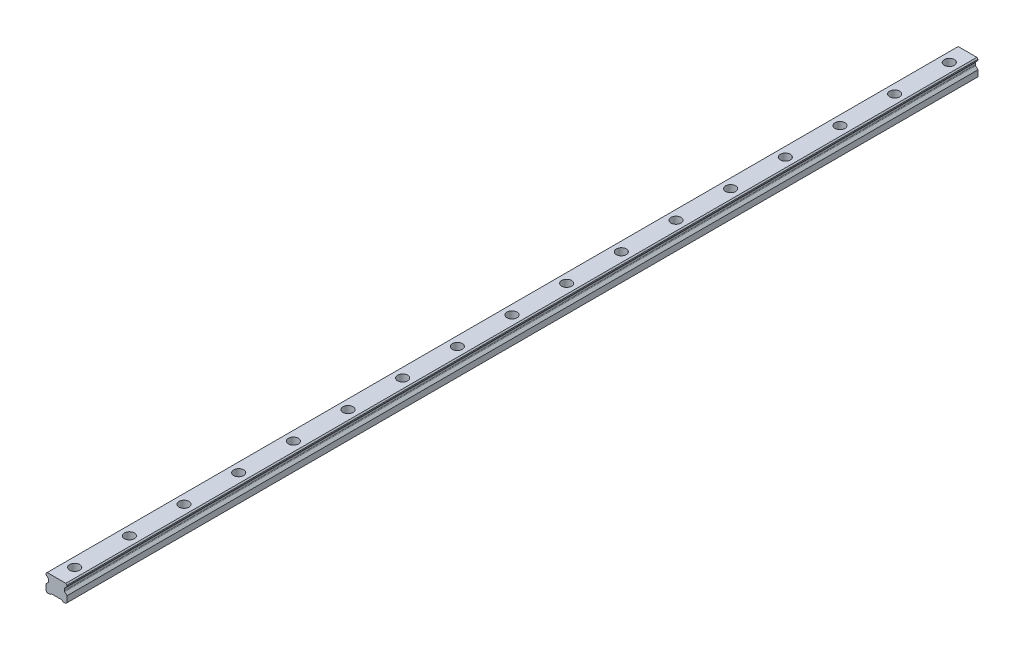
ISO-10303-21;
HEADER;
FILE_DESCRIPTION(('STEP AP214'),'2;1');
FILE_NAME('part.step','',(''),(''),'','','');
FILE_SCHEMA(('AUTOMOTIVE_DESIGN { 1 0 10303 214 1 1 1 1 }'));
ENDSEC;
DATA;
#1=APPLICATION_CONTEXT('core data for automotive mechanical design processes');
#2=APPLICATION_PROTOCOL_DEFINITION('international standard','automotive_design',2000,#1);
#3=PRODUCT_CONTEXT('',#1,'mechanical');
#4=PRODUCT('Part','Part','',(#3));
#5=PRODUCT_RELATED_PRODUCT_CATEGORY('part','',(#4));
#6=PRODUCT_DEFINITION_FORMATION('','',#4);
#7=PRODUCT_DEFINITION_CONTEXT('part definition',#1,'design');
#8=PRODUCT_DEFINITION('design','',#6,#7);
#9=PRODUCT_DEFINITION_SHAPE('','',#8);
#10=(LENGTH_UNIT() NAMED_UNIT(*) SI_UNIT(.MILLI.,.METRE.));
#11=(NAMED_UNIT(*) PLANE_ANGLE_UNIT() SI_UNIT($,.RADIAN.));
#12=(NAMED_UNIT(*) SI_UNIT($,.STERADIAN.) SOLID_ANGLE_UNIT());
#13=UNCERTAINTY_MEASURE_WITH_UNIT(LENGTH_MEASURE(1.E-05),#10,'distance_accuracy_value','');
#14=(GEOMETRIC_REPRESENTATION_CONTEXT(3) GLOBAL_UNCERTAINTY_ASSIGNED_CONTEXT((#13)) GLOBAL_UNIT_ASSIGNED_CONTEXT((#10,
#11,#12)) REPRESENTATION_CONTEXT('',''));
#15=CARTESIAN_POINT('',(0.,0.,0.));
#16=DIRECTION('',(0.,0.,1.));
#17=DIRECTION('',(1.,0.,0.));
#18=AXIS2_PLACEMENT_3D('',#15,#16,#17);
#19=CARTESIAN_POINT('',(0.,10.2,-480.));
#20=DIRECTION('',(0.,1.,0.));
#21=DIRECTION('',(0.,0.,1.));
#22=AXIS2_PLACEMENT_3D('',#19,#20,#21);
#23=PLANE('',#22);
#24=CARTESIAN_POINT('',(0.,10.2,-480.));
#25=DIRECTION('',(0.,1.,0.));
#26=DIRECTION('',(0.,0.,1.));
#27=AXIS2_PLACEMENT_3D('',#24,#25,#26);
#28=CIRCLE('',#27,3.5);
#29=CARTESIAN_POINT('',(0.,10.2,-476.5));
#30=VERTEX_POINT('',#29);
#31=EDGE_CURVE('E478',#30,#30,#28,.T.);
#32=ORIENTED_EDGE('',*,*,#31,.F.);
#33=EDGE_LOOP('',(#32));
#34=FACE_BOUND('',#33,.T.);
#35=CARTESIAN_POINT('',(0.,10.2,-480.));
#36=DIRECTION('',(0.,1.,0.));
#37=DIRECTION('',(0.,0.,1.));
#38=AXIS2_PLACEMENT_3D('',#35,#36,#37);
#39=CIRCLE('',#38,5.5);
#40=CARTESIAN_POINT('',(0.,10.2,-474.5));
#41=VERTEX_POINT('',#40);
#42=EDGE_CURVE('E11',#41,#41,#39,.T.);
#43=ORIENTED_EDGE('',*,*,#42,.T.);
#44=EDGE_LOOP('',(#43));
#45=FACE_BOUND('',#44,.T.);
#46=ADVANCED_FACE('F39',(#34,#45),#23,.T.);
#47=CARTESIAN_POINT('',(0.,10.2,-480.));
#48=DIRECTION('',(0.,1.,0.));
#49=DIRECTION('',(0.,0.,1.));
#50=AXIS2_PLACEMENT_3D('',#47,#48,#49);
#51=CYLINDRICAL_SURFACE('',#50,5.5);
#52=ORIENTED_EDGE('',*,*,#42,.F.);
#53=EDGE_LOOP('',(#52));
#54=FACE_BOUND('',#53,.T.);
#55=CARTESIAN_POINT('',(0.,19.2,-480.));
#56=DIRECTION('',(0.,1.,0.));
#57=DIRECTION('',(0.,0.,1.));
#58=AXIS2_PLACEMENT_3D('',#55,#56,#57);
#59=CIRCLE('',#58,5.5);
#60=CARTESIAN_POINT('',(0.,19.2,-474.5));
#61=VERTEX_POINT('',#60);
#62=EDGE_CURVE('E48',#61,#61,#59,.T.);
#63=ORIENTED_EDGE('',*,*,#62,.T.);
#64=EDGE_LOOP('',(#63));
#65=FACE_BOUND('',#64,.T.);
#66=ADVANCED_FACE('F801',(#54,#65),#51,.F.);
#67=CARTESIAN_POINT('',(0.,10.2,-420.));
#68=DIRECTION('',(0.,1.,0.));
#69=DIRECTION('',(0.,0.,1.));
#70=AXIS2_PLACEMENT_3D('',#67,#68,#69);
#71=PLANE('',#70);
#72=CARTESIAN_POINT('',(0.,10.2,-420.));
#73=DIRECTION('',(0.,1.,0.));
#74=DIRECTION('',(0.,0.,1.));
#75=AXIS2_PLACEMENT_3D('',#72,#73,#74);
#76=CIRCLE('',#75,3.5);
#77=CARTESIAN_POINT('',(0.,10.2,-416.5));
#78=VERTEX_POINT('',#77);
#79=EDGE_CURVE('E483',#78,#78,#76,.T.);
#80=ORIENTED_EDGE('',*,*,#79,.F.);
#81=EDGE_LOOP('',(#80));
#82=FACE_BOUND('',#81,.T.);
#83=CARTESIAN_POINT('',(0.,10.2,-420.));
#84=DIRECTION('',(0.,1.,0.));
#85=DIRECTION('',(0.,0.,1.));
#86=AXIS2_PLACEMENT_3D('',#83,#84,#85);
#87=CIRCLE('',#86,5.5);
#88=CARTESIAN_POINT('',(0.,10.2,-414.5));
#89=VERTEX_POINT('',#88);
#90=EDGE_CURVE('E462',#89,#89,#87,.T.);
#91=ORIENTED_EDGE('',*,*,#90,.T.);
#92=EDGE_LOOP('',(#91));
#93=FACE_BOUND('',#92,.T.);
#94=ADVANCED_FACE('F803',(#82,#93),#71,.T.);
#95=CARTESIAN_POINT('',(0.,10.2,-420.));
#96=DIRECTION('',(0.,1.,0.));
#97=DIRECTION('',(0.,0.,1.));
#98=AXIS2_PLACEMENT_3D('',#95,#96,#97);
#99=CYLINDRICAL_SURFACE('',#98,5.5);
#100=ORIENTED_EDGE('',*,*,#90,.F.);
#101=EDGE_LOOP('',(#100));
#102=FACE_BOUND('',#101,.T.);
#103=CARTESIAN_POINT('',(0.,19.2,-420.));
#104=DIRECTION('',(0.,1.,0.));
#105=DIRECTION('',(0.,0.,1.));
#106=AXIS2_PLACEMENT_3D('',#103,#104,#105);
#107=CIRCLE('',#106,5.5);
#108=CARTESIAN_POINT('',(0.,19.2,-414.5));
#109=VERTEX_POINT('',#108);
#110=EDGE_CURVE('E458',#109,#109,#107,.T.);
#111=ORIENTED_EDGE('',*,*,#110,.T.);
#112=EDGE_LOOP('',(#111));
#113=FACE_BOUND('',#112,.T.);
#114=ADVANCED_FACE('F809',(#102,#113),#99,.F.);
#115=CARTESIAN_POINT('',(0.,10.2,-360.));
#116=DIRECTION('',(0.,1.,0.));
#117=DIRECTION('',(0.,0.,1.));
#118=AXIS2_PLACEMENT_3D('',#115,#116,#117);
#119=PLANE('',#118);
#120=CARTESIAN_POINT('',(0.,10.2,-360.));
#121=DIRECTION('',(0.,1.,0.));
#122=DIRECTION('',(0.,0.,1.));
#123=AXIS2_PLACEMENT_3D('',#120,#121,#122);
#124=CIRCLE('',#123,3.5);
#125=CARTESIAN_POINT('',(0.,10.2,-356.5));
#126=VERTEX_POINT('',#125);
#127=EDGE_CURVE('E488',#126,#126,#124,.T.);
#128=ORIENTED_EDGE('',*,*,#127,.F.);
#129=EDGE_LOOP('',(#128));
#130=FACE_BOUND('',#129,.T.);
#131=CARTESIAN_POINT('',(0.,10.2,-360.));
#132=DIRECTION('',(0.,1.,0.));
#133=DIRECTION('',(0.,0.,1.));
#134=AXIS2_PLACEMENT_3D('',#131,#132,#133);
#135=CIRCLE('',#134,5.5);
#136=CARTESIAN_POINT('',(0.,10.2,-354.5));
#137=VERTEX_POINT('',#136);
#138=EDGE_CURVE('E454',#137,#137,#135,.T.);
#139=ORIENTED_EDGE('',*,*,#138,.T.);
#140=EDGE_LOOP('',(#139));
#141=FACE_BOUND('',#140,.T.);
#142=ADVANCED_FACE('F817',(#130,#141),#119,.T.);
#143=CARTESIAN_POINT('',(0.,10.2,-360.));
#144=DIRECTION('',(0.,1.,0.));
#145=DIRECTION('',(0.,0.,1.));
#146=AXIS2_PLACEMENT_3D('',#143,#144,#145);
#147=CYLINDRICAL_SURFACE('',#146,5.5);
#148=ORIENTED_EDGE('',*,*,#138,.F.);
#149=EDGE_LOOP('',(#148));
#150=FACE_BOUND('',#149,.T.);
#151=CARTESIAN_POINT('',(0.,19.2,-360.));
#152=DIRECTION('',(0.,1.,0.));
#153=DIRECTION('',(0.,0.,1.));
#154=AXIS2_PLACEMENT_3D('',#151,#152,#153);
#155=CIRCLE('',#154,5.5);
#156=CARTESIAN_POINT('',(0.,19.2,-354.5));
#157=VERTEX_POINT('',#156);
#158=EDGE_CURVE('E450',#157,#157,#155,.T.);
#159=ORIENTED_EDGE('',*,*,#158,.T.);
#160=EDGE_LOOP('',(#159));
#161=FACE_BOUND('',#160,.T.);
#162=ADVANCED_FACE('F821',(#150,#161),#147,.F.);
#163=CARTESIAN_POINT('',(0.,10.2,-300.));
#164=DIRECTION('',(0.,1.,0.));
#165=DIRECTION('',(0.,0.,1.));
#166=AXIS2_PLACEMENT_3D('',#163,#164,#165);
#167=PLANE('',#166);
#168=CARTESIAN_POINT('',(0.,10.2,-300.));
#169=DIRECTION('',(0.,1.,0.));
#170=DIRECTION('',(0.,0.,1.));
#171=AXIS2_PLACEMENT_3D('',#168,#169,#170);
#172=CIRCLE('',#171,3.5);
#173=CARTESIAN_POINT('',(0.,10.2,-296.5));
#174=VERTEX_POINT('',#173);
#175=EDGE_CURVE('E493',#174,#174,#172,.T.);
#176=ORIENTED_EDGE('',*,*,#175,.F.);
#177=EDGE_LOOP('',(#176));
#178=FACE_BOUND('',#177,.T.);
#179=CARTESIAN_POINT('',(0.,10.2,-300.));
#180=DIRECTION('',(0.,1.,0.));
#181=DIRECTION('',(0.,0.,1.));
#182=AXIS2_PLACEMENT_3D('',#179,#180,#181);
#183=CIRCLE('',#182,5.5);
#184=CARTESIAN_POINT('',(0.,10.2,-294.5));
#185=VERTEX_POINT('',#184);
#186=EDGE_CURVE('E446',#185,#185,#183,.T.);
#187=ORIENTED_EDGE('',*,*,#186,.T.);
#188=EDGE_LOOP('',(#187));
#189=FACE_BOUND('',#188,.T.);
#190=ADVANCED_FACE('F825',(#178,#189),#167,.T.);
#191=CARTESIAN_POINT('',(0.,10.2,-300.));
#192=DIRECTION('',(0.,1.,0.));
#193=DIRECTION('',(0.,0.,1.));
#194=AXIS2_PLACEMENT_3D('',#191,#192,#193);
#195=CYLINDRICAL_SURFACE('',#194,5.5);
#196=ORIENTED_EDGE('',*,*,#186,.F.);
#197=EDGE_LOOP('',(#196));
#198=FACE_BOUND('',#197,.T.);
#199=CARTESIAN_POINT('',(0.,19.2,-300.));
#200=DIRECTION('',(0.,1.,0.));
#201=DIRECTION('',(0.,0.,1.));
#202=AXIS2_PLACEMENT_3D('',#199,#200,#201);
#203=CIRCLE('',#202,5.5);
#204=CARTESIAN_POINT('',(0.,19.2,-294.5));
#205=VERTEX_POINT('',#204);
#206=EDGE_CURVE('E442',#205,#205,#203,.T.);
#207=ORIENTED_EDGE('',*,*,#206,.T.);
#208=EDGE_LOOP('',(#207));
#209=FACE_BOUND('',#208,.T.);
#210=ADVANCED_FACE('F829',(#198,#209),#195,.F.);
#211=CARTESIAN_POINT('',(0.,10.2,-240.));
#212=DIRECTION('',(0.,1.,0.));
#213=DIRECTION('',(0.,0.,1.));
#214=AXIS2_PLACEMENT_3D('',#211,#212,#213);
#215=PLANE('',#214);
#216=CARTESIAN_POINT('',(0.,10.2,-240.));
#217=DIRECTION('',(0.,1.,0.));
#218=DIRECTION('',(0.,0.,1.));
#219=AXIS2_PLACEMENT_3D('',#216,#217,#218);
#220=CIRCLE('',#219,3.5);
#221=CARTESIAN_POINT('',(0.,10.2,-236.5));
#222=VERTEX_POINT('',#221);
#223=EDGE_CURVE('E498',#222,#222,#220,.T.);
#224=ORIENTED_EDGE('',*,*,#223,.F.);
#225=EDGE_LOOP('',(#224));
#226=FACE_BOUND('',#225,.T.);
#227=CARTESIAN_POINT('',(0.,10.2,-240.));
#228=DIRECTION('',(0.,1.,0.));
#229=DIRECTION('',(0.,0.,1.));
#230=AXIS2_PLACEMENT_3D('',#227,#228,#229);
#231=CIRCLE('',#230,5.5);
#232=CARTESIAN_POINT('',(0.,10.2,-234.5));
#233=VERTEX_POINT('',#232);
#234=EDGE_CURVE('E438',#233,#233,#231,.T.);
#235=ORIENTED_EDGE('',*,*,#234,.T.);
#236=EDGE_LOOP('',(#235));
#237=FACE_BOUND('',#236,.T.);
#238=ADVANCED_FACE('F833',(#226,#237),#215,.T.);
#239=CARTESIAN_POINT('',(0.,10.2,-240.));
#240=DIRECTION('',(0.,1.,0.));
#241=DIRECTION('',(0.,0.,1.));
#242=AXIS2_PLACEMENT_3D('',#239,#240,#241);
#243=CYLINDRICAL_SURFACE('',#242,5.5);
#244=ORIENTED_EDGE('',*,*,#234,.F.);
#245=EDGE_LOOP('',(#244));
#246=FACE_BOUND('',#245,.T.);
#247=CARTESIAN_POINT('',(0.,19.2,-240.));
#248=DIRECTION('',(0.,1.,0.));
#249=DIRECTION('',(0.,0.,1.));
#250=AXIS2_PLACEMENT_3D('',#247,#248,#249);
#251=CIRCLE('',#250,5.5);
#252=CARTESIAN_POINT('',(0.,19.2,-234.5));
#253=VERTEX_POINT('',#252);
#254=EDGE_CURVE('E434',#253,#253,#251,.T.);
#255=ORIENTED_EDGE('',*,*,#254,.T.);
#256=EDGE_LOOP('',(#255));
#257=FACE_BOUND('',#256,.T.);
#258=ADVANCED_FACE('F837',(#246,#257),#243,.F.);
#259=CARTESIAN_POINT('',(0.,10.2,-180.));
#260=DIRECTION('',(0.,1.,0.));
#261=DIRECTION('',(0.,0.,1.));
#262=AXIS2_PLACEMENT_3D('',#259,#260,#261);
#263=PLANE('',#262);
#264=CARTESIAN_POINT('',(0.,10.2,-180.));
#265=DIRECTION('',(0.,1.,0.));
#266=DIRECTION('',(0.,0.,1.));
#267=AXIS2_PLACEMENT_3D('',#264,#265,#266);
#268=CIRCLE('',#267,3.5);
#269=CARTESIAN_POINT('',(0.,10.2,-176.5));
#270=VERTEX_POINT('',#269);
#271=EDGE_CURVE('E503',#270,#270,#268,.T.);
#272=ORIENTED_EDGE('',*,*,#271,.F.);
#273=EDGE_LOOP('',(#272));
#274=FACE_BOUND('',#273,.T.);
#275=CARTESIAN_POINT('',(0.,10.2,-180.));
#276=DIRECTION('',(0.,1.,0.));
#277=DIRECTION('',(0.,0.,1.));
#278=AXIS2_PLACEMENT_3D('',#275,#276,#277);
#279=CIRCLE('',#278,5.5);
#280=CARTESIAN_POINT('',(0.,10.2,-174.5));
#281=VERTEX_POINT('',#280);
#282=EDGE_CURVE('E430',#281,#281,#279,.T.);
#283=ORIENTED_EDGE('',*,*,#282,.T.);
#284=EDGE_LOOP('',(#283));
#285=FACE_BOUND('',#284,.T.);
#286=ADVANCED_FACE('F841',(#274,#285),#263,.T.);
#287=CARTESIAN_POINT('',(0.,10.2,-180.));
#288=DIRECTION('',(0.,1.,0.));
#289=DIRECTION('',(0.,0.,1.));
#290=AXIS2_PLACEMENT_3D('',#287,#288,#289);
#291=CYLINDRICAL_SURFACE('',#290,5.5);
#292=ORIENTED_EDGE('',*,*,#282,.F.);
#293=EDGE_LOOP('',(#292));
#294=FACE_BOUND('',#293,.T.);
#295=CARTESIAN_POINT('',(0.,19.2,-180.));
#296=DIRECTION('',(0.,1.,0.));
#297=DIRECTION('',(0.,0.,1.));
#298=AXIS2_PLACEMENT_3D('',#295,#296,#297);
#299=CIRCLE('',#298,5.5);
#300=CARTESIAN_POINT('',(0.,19.2,-174.5));
#301=VERTEX_POINT('',#300);
#302=EDGE_CURVE('E426',#301,#301,#299,.T.);
#303=ORIENTED_EDGE('',*,*,#302,.T.);
#304=EDGE_LOOP('',(#303));
#305=FACE_BOUND('',#304,.T.);
#306=ADVANCED_FACE('F845',(#294,#305),#291,.F.);
#307=CARTESIAN_POINT('',(0.,10.2,-120.));
#308=DIRECTION('',(0.,1.,0.));
#309=DIRECTION('',(0.,0.,1.));
#310=AXIS2_PLACEMENT_3D('',#307,#308,#309);
#311=PLANE('',#310);
#312=CARTESIAN_POINT('',(0.,10.2,-120.));
#313=DIRECTION('',(0.,1.,0.));
#314=DIRECTION('',(0.,0.,1.));
#315=AXIS2_PLACEMENT_3D('',#312,#313,#314);
#316=CIRCLE('',#315,3.5);
#317=CARTESIAN_POINT('',(0.,10.2,-116.5));
#318=VERTEX_POINT('',#317);
#319=EDGE_CURVE('E508',#318,#318,#316,.T.);
#320=ORIENTED_EDGE('',*,*,#319,.F.);
#321=EDGE_LOOP('',(#320));
#322=FACE_BOUND('',#321,.T.);
#323=CARTESIAN_POINT('',(0.,10.2,-120.));
#324=DIRECTION('',(0.,1.,0.));
#325=DIRECTION('',(0.,0.,1.));
#326=AXIS2_PLACEMENT_3D('',#323,#324,#325);
#327=CIRCLE('',#326,5.5);
#328=CARTESIAN_POINT('',(0.,10.2,-114.5));
#329=VERTEX_POINT('',#328);
#330=EDGE_CURVE('E422',#329,#329,#327,.T.);
#331=ORIENTED_EDGE('',*,*,#330,.T.);
#332=EDGE_LOOP('',(#331));
#333=FACE_BOUND('',#332,.T.);
#334=ADVANCED_FACE('F849',(#322,#333),#311,.T.);
#335=CARTESIAN_POINT('',(0.,10.2,-120.));
#336=DIRECTION('',(0.,1.,0.));
#337=DIRECTION('',(0.,0.,1.));
#338=AXIS2_PLACEMENT_3D('',#335,#336,#337);
#339=CYLINDRICAL_SURFACE('',#338,5.5);
#340=ORIENTED_EDGE('',*,*,#330,.F.);
#341=EDGE_LOOP('',(#340));
#342=FACE_BOUND('',#341,.T.);
#343=CARTESIAN_POINT('',(0.,19.2,-120.));
#344=DIRECTION('',(0.,1.,0.));
#345=DIRECTION('',(0.,0.,1.));
#346=AXIS2_PLACEMENT_3D('',#343,#344,#345);
#347=CIRCLE('',#346,5.5);
#348=CARTESIAN_POINT('',(0.,19.2,-114.5));
#349=VERTEX_POINT('',#348);
#350=EDGE_CURVE('E418',#349,#349,#347,.T.);
#351=ORIENTED_EDGE('',*,*,#350,.T.);
#352=EDGE_LOOP('',(#351));
#353=FACE_BOUND('',#352,.T.);
#354=ADVANCED_FACE('F853',(#342,#353),#339,.F.);
#355=CARTESIAN_POINT('',(0.,10.2,-60.0000000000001));
#356=DIRECTION('',(0.,1.,0.));
#357=DIRECTION('',(0.,0.,1.));
#358=AXIS2_PLACEMENT_3D('',#355,#356,#357);
#359=PLANE('',#358);
#360=CARTESIAN_POINT('',(0.,10.2,-60.0000000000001));
#361=DIRECTION('',(0.,1.,0.));
#362=DIRECTION('',(0.,0.,1.));
#363=AXIS2_PLACEMENT_3D('',#360,#361,#362);
#364=CIRCLE('',#363,3.5);
#365=CARTESIAN_POINT('',(0.,10.2,-56.5));
#366=VERTEX_POINT('',#365);
#367=EDGE_CURVE('E513',#366,#366,#364,.T.);
#368=ORIENTED_EDGE('',*,*,#367,.F.);
#369=EDGE_LOOP('',(#368));
#370=FACE_BOUND('',#369,.T.);
#371=CARTESIAN_POINT('',(0.,10.2,-60.0000000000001));
#372=DIRECTION('',(0.,1.,0.));
#373=DIRECTION('',(0.,0.,1.));
#374=AXIS2_PLACEMENT_3D('',#371,#372,#373);
#375=CIRCLE('',#374,5.5);
#376=CARTESIAN_POINT('',(0.,10.2,-54.5000000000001));
#377=VERTEX_POINT('',#376);
#378=EDGE_CURVE('E414',#377,#377,#375,.T.);
#379=ORIENTED_EDGE('',*,*,#378,.T.);
#380=EDGE_LOOP('',(#379));
#381=FACE_BOUND('',#380,.T.);
#382=ADVANCED_FACE('F857',(#370,#381),#359,.T.);
#383=CARTESIAN_POINT('',(0.,10.2,-60.0000000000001));
#384=DIRECTION('',(0.,1.,0.));
#385=DIRECTION('',(0.,0.,1.));
#386=AXIS2_PLACEMENT_3D('',#383,#384,#385);
#387=CYLINDRICAL_SURFACE('',#386,5.5);
#388=ORIENTED_EDGE('',*,*,#378,.F.);
#389=EDGE_LOOP('',(#388));
#390=FACE_BOUND('',#389,.T.);
#391=CARTESIAN_POINT('',(0.,19.2,-60.0000000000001));
#392=DIRECTION('',(0.,1.,0.));
#393=DIRECTION('',(0.,0.,1.));
#394=AXIS2_PLACEMENT_3D('',#391,#392,#393);
#395=CIRCLE('',#394,5.5);
#396=CARTESIAN_POINT('',(0.,19.2,-54.5000000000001));
#397=VERTEX_POINT('',#396);
#398=EDGE_CURVE('E410',#397,#397,#395,.T.);
#399=ORIENTED_EDGE('',*,*,#398,.T.);
#400=EDGE_LOOP('',(#399));
#401=FACE_BOUND('',#400,.T.);
#402=ADVANCED_FACE('F861',(#390,#401),#387,.F.);
#403=CARTESIAN_POINT('',(0.,10.2,0.));
#404=DIRECTION('',(0.,1.,0.));
#405=DIRECTION('',(0.,0.,1.));
#406=AXIS2_PLACEMENT_3D('',#403,#404,#405);
#407=PLANE('',#406);
#408=CARTESIAN_POINT('',(0.,10.2,0.));
#409=DIRECTION('',(0.,1.,0.));
#410=DIRECTION('',(0.,0.,1.));
#411=AXIS2_PLACEMENT_3D('',#408,#409,#410);
#412=CIRCLE('',#411,3.5);
#413=CARTESIAN_POINT('',(0.,10.2,3.5));
#414=VERTEX_POINT('',#413);
#415=EDGE_CURVE('E518',#414,#414,#412,.T.);
#416=ORIENTED_EDGE('',*,*,#415,.F.);
#417=EDGE_LOOP('',(#416));
#418=FACE_BOUND('',#417,.T.);
#419=CARTESIAN_POINT('',(0.,10.2,0.));
#420=DIRECTION('',(0.,1.,0.));
#421=DIRECTION('',(0.,0.,1.));
#422=AXIS2_PLACEMENT_3D('',#419,#420,#421);
#423=CIRCLE('',#422,5.5);
#424=CARTESIAN_POINT('',(0.,10.2,5.5));
#425=VERTEX_POINT('',#424);
#426=EDGE_CURVE('E406',#425,#425,#423,.T.);
#427=ORIENTED_EDGE('',*,*,#426,.T.);
#428=EDGE_LOOP('',(#427));
#429=FACE_BOUND('',#428,.T.);
#430=ADVANCED_FACE('F865',(#418,#429),#407,.T.);
#431=CARTESIAN_POINT('',(0.,10.2,0.));
#432=DIRECTION('',(0.,1.,0.));
#433=DIRECTION('',(0.,0.,1.));
#434=AXIS2_PLACEMENT_3D('',#431,#432,#433);
#435=CYLINDRICAL_SURFACE('',#434,5.5);
#436=ORIENTED_EDGE('',*,*,#426,.F.);
#437=EDGE_LOOP('',(#436));
#438=FACE_BOUND('',#437,.T.);
#439=CARTESIAN_POINT('',(0.,19.2,0.));
#440=DIRECTION('',(0.,1.,0.));
#441=DIRECTION('',(0.,0.,1.));
#442=AXIS2_PLACEMENT_3D('',#439,#440,#441);
#443=CIRCLE('',#442,5.5);
#444=CARTESIAN_POINT('',(0.,19.2,5.5));
#445=VERTEX_POINT('',#444);
#446=EDGE_CURVE('E402',#445,#445,#443,.T.);
#447=ORIENTED_EDGE('',*,*,#446,.T.);
#448=EDGE_LOOP('',(#447));
#449=FACE_BOUND('',#448,.T.);
#450=ADVANCED_FACE('F869',(#438,#449),#435,.F.);
#451=CARTESIAN_POINT('',(0.,10.2,60.));
#452=DIRECTION('',(0.,1.,0.));
#453=DIRECTION('',(0.,0.,1.));
#454=AXIS2_PLACEMENT_3D('',#451,#452,#453);
#455=PLANE('',#454);
#456=CARTESIAN_POINT('',(0.,10.2,60.));
#457=DIRECTION('',(0.,1.,0.));
#458=DIRECTION('',(0.,0.,1.));
#459=AXIS2_PLACEMENT_3D('',#456,#457,#458);
#460=CIRCLE('',#459,3.5);
#461=CARTESIAN_POINT('',(0.,10.2,63.5));
#462=VERTEX_POINT('',#461);
#463=EDGE_CURVE('E523',#462,#462,#460,.T.);
#464=ORIENTED_EDGE('',*,*,#463,.F.);
#465=EDGE_LOOP('',(#464));
#466=FACE_BOUND('',#465,.T.);
#467=CARTESIAN_POINT('',(0.,10.2,60.));
#468=DIRECTION('',(0.,1.,0.));
#469=DIRECTION('',(0.,0.,1.));
#470=AXIS2_PLACEMENT_3D('',#467,#468,#469);
#471=CIRCLE('',#470,5.5);
#472=CARTESIAN_POINT('',(0.,10.2,65.5));
#473=VERTEX_POINT('',#472);
#474=EDGE_CURVE('E398',#473,#473,#471,.T.);
#475=ORIENTED_EDGE('',*,*,#474,.T.);
#476=EDGE_LOOP('',(#475));
#477=FACE_BOUND('',#476,.T.);
#478=ADVANCED_FACE('F873',(#466,#477),#455,.T.);
#479=CARTESIAN_POINT('',(0.,10.2,60.));
#480=DIRECTION('',(0.,1.,0.));
#481=DIRECTION('',(0.,0.,1.));
#482=AXIS2_PLACEMENT_3D('',#479,#480,#481);
#483=CYLINDRICAL_SURFACE('',#482,5.5);
#484=ORIENTED_EDGE('',*,*,#474,.F.);
#485=EDGE_LOOP('',(#484));
#486=FACE_BOUND('',#485,.T.);
#487=CARTESIAN_POINT('',(0.,19.2,60.));
#488=DIRECTION('',(0.,1.,0.));
#489=DIRECTION('',(0.,0.,1.));
#490=AXIS2_PLACEMENT_3D('',#487,#488,#489);
#491=CIRCLE('',#490,5.5);
#492=CARTESIAN_POINT('',(0.,19.2,65.5));
#493=VERTEX_POINT('',#492);
#494=EDGE_CURVE('E394',#493,#493,#491,.T.);
#495=ORIENTED_EDGE('',*,*,#494,.T.);
#496=EDGE_LOOP('',(#495));
#497=FACE_BOUND('',#496,.T.);
#498=ADVANCED_FACE('F765',(#486,#497),#483,.F.);
#499=CARTESIAN_POINT('',(0.,10.2,120.));
#500=DIRECTION('',(0.,1.,0.));
#501=DIRECTION('',(0.,0.,1.));
#502=AXIS2_PLACEMENT_3D('',#499,#500,#501);
#503=PLANE('',#502);
#504=CARTESIAN_POINT('',(0.,10.2,120.));
#505=DIRECTION('',(0.,1.,0.));
#506=DIRECTION('',(0.,0.,1.));
#507=AXIS2_PLACEMENT_3D('',#504,#505,#506);
#508=CIRCLE('',#507,3.5);
#509=CARTESIAN_POINT('',(0.,10.2,123.5));
#510=VERTEX_POINT('',#509);
#511=EDGE_CURVE('E528',#510,#510,#508,.T.);
#512=ORIENTED_EDGE('',*,*,#511,.F.);
#513=EDGE_LOOP('',(#512));
#514=FACE_BOUND('',#513,.T.);
#515=CARTESIAN_POINT('',(0.,10.2,120.));
#516=DIRECTION('',(0.,1.,0.));
#517=DIRECTION('',(0.,0.,1.));
#518=AXIS2_PLACEMENT_3D('',#515,#516,#517);
#519=CIRCLE('',#518,5.5);
#520=CARTESIAN_POINT('',(0.,10.2,125.5));
#521=VERTEX_POINT('',#520);
#522=EDGE_CURVE('E390',#521,#521,#519,.T.);
#523=ORIENTED_EDGE('',*,*,#522,.T.);
#524=EDGE_LOOP('',(#523));
#525=FACE_BOUND('',#524,.T.);
#526=ADVANCED_FACE('F761',(#514,#525),#503,.T.);
#527=CARTESIAN_POINT('',(0.,10.2,120.));
#528=DIRECTION('',(0.,1.,0.));
#529=DIRECTION('',(0.,0.,1.));
#530=AXIS2_PLACEMENT_3D('',#527,#528,#529);
#531=CYLINDRICAL_SURFACE('',#530,5.5);
#532=ORIENTED_EDGE('',*,*,#522,.F.);
#533=EDGE_LOOP('',(#532));
#534=FACE_BOUND('',#533,.T.);
#535=CARTESIAN_POINT('',(0.,19.2,120.));
#536=DIRECTION('',(0.,1.,0.));
#537=DIRECTION('',(0.,0.,1.));
#538=AXIS2_PLACEMENT_3D('',#535,#536,#537);
#539=CIRCLE('',#538,5.5);
#540=CARTESIAN_POINT('',(0.,19.2,125.5));
#541=VERTEX_POINT('',#540);
#542=EDGE_CURVE('E386',#541,#541,#539,.T.);
#543=ORIENTED_EDGE('',*,*,#542,.T.);
#544=EDGE_LOOP('',(#543));
#545=FACE_BOUND('',#544,.T.);
#546=ADVANCED_FACE('F764',(#534,#545),#531,.F.);
#547=CARTESIAN_POINT('',(0.,10.2,180.));
#548=DIRECTION('',(0.,1.,0.));
#549=DIRECTION('',(0.,0.,1.));
#550=AXIS2_PLACEMENT_3D('',#547,#548,#549);
#551=PLANE('',#550);
#552=CARTESIAN_POINT('',(0.,10.2,180.));
#553=DIRECTION('',(0.,1.,0.));
#554=DIRECTION('',(0.,0.,1.));
#555=AXIS2_PLACEMENT_3D('',#552,#553,#554);
#556=CIRCLE('',#555,3.5);
#557=CARTESIAN_POINT('',(0.,10.2,183.5));
#558=VERTEX_POINT('',#557);
#559=EDGE_CURVE('E533',#558,#558,#556,.T.);
#560=ORIENTED_EDGE('',*,*,#559,.F.);
#561=EDGE_LOOP('',(#560));
#562=FACE_BOUND('',#561,.T.);
#563=CARTESIAN_POINT('',(0.,10.2,180.));
#564=DIRECTION('',(0.,1.,0.));
#565=DIRECTION('',(0.,0.,1.));
#566=AXIS2_PLACEMENT_3D('',#563,#564,#565);
#567=CIRCLE('',#566,5.5);
#568=CARTESIAN_POINT('',(0.,10.2,185.5));
#569=VERTEX_POINT('',#568);
#570=EDGE_CURVE('E382',#569,#569,#567,.T.);
#571=ORIENTED_EDGE('',*,*,#570,.T.);
#572=EDGE_LOOP('',(#571));
#573=FACE_BOUND('',#572,.T.);
#574=ADVANCED_FACE('F771',(#562,#573),#551,.T.);
#575=CARTESIAN_POINT('',(0.,10.2,180.));
#576=DIRECTION('',(0.,1.,0.));
#577=DIRECTION('',(0.,0.,1.));
#578=AXIS2_PLACEMENT_3D('',#575,#576,#577);
#579=CYLINDRICAL_SURFACE('',#578,5.5);
#580=ORIENTED_EDGE('',*,*,#570,.F.);
#581=EDGE_LOOP('',(#580));
#582=FACE_BOUND('',#581,.T.);
#583=CARTESIAN_POINT('',(0.,19.2,180.));
#584=DIRECTION('',(0.,1.,0.));
#585=DIRECTION('',(0.,0.,1.));
#586=AXIS2_PLACEMENT_3D('',#583,#584,#585);
#587=CIRCLE('',#586,5.5);
#588=CARTESIAN_POINT('',(0.,19.2,185.5));
#589=VERTEX_POINT('',#588);
#590=EDGE_CURVE('E378',#589,#589,#587,.T.);
#591=ORIENTED_EDGE('',*,*,#590,.T.);
#592=EDGE_LOOP('',(#591));
#593=FACE_BOUND('',#592,.T.);
#594=ADVANCED_FACE('F883',(#582,#593),#579,.F.);
#595=CARTESIAN_POINT('',(0.,10.2,240.));
#596=DIRECTION('',(0.,1.,0.));
#597=DIRECTION('',(0.,0.,1.));
#598=AXIS2_PLACEMENT_3D('',#595,#596,#597);
#599=PLANE('',#598);
#600=CARTESIAN_POINT('',(0.,10.2,240.));
#601=DIRECTION('',(0.,1.,0.));
#602=DIRECTION('',(0.,0.,1.));
#603=AXIS2_PLACEMENT_3D('',#600,#601,#602);
#604=CIRCLE('',#603,3.5);
#605=CARTESIAN_POINT('',(0.,10.2,243.5));
#606=VERTEX_POINT('',#605);
#607=EDGE_CURVE('E537',#606,#606,#604,.T.);
#608=ORIENTED_EDGE('',*,*,#607,.F.);
#609=EDGE_LOOP('',(#608));
#610=FACE_BOUND('',#609,.T.);
#611=CARTESIAN_POINT('',(0.,10.2,240.));
#612=DIRECTION('',(0.,1.,0.));
#613=DIRECTION('',(0.,0.,1.));
#614=AXIS2_PLACEMENT_3D('',#611,#612,#613);
#615=CIRCLE('',#614,5.5);
#616=CARTESIAN_POINT('',(0.,10.2,245.5));
#617=VERTEX_POINT('',#616);
#618=EDGE_CURVE('E374',#617,#617,#615,.T.);
#619=ORIENTED_EDGE('',*,*,#618,.T.);
#620=EDGE_LOOP('',(#619));
#621=FACE_BOUND('',#620,.T.);
#622=ADVANCED_FACE('F887',(#610,#621),#599,.T.);
#623=CARTESIAN_POINT('',(0.,10.2,240.));
#624=DIRECTION('',(0.,1.,0.));
#625=DIRECTION('',(0.,0.,1.));
#626=AXIS2_PLACEMENT_3D('',#623,#624,#625);
#627=CYLINDRICAL_SURFACE('',#626,5.5);
#628=ORIENTED_EDGE('',*,*,#618,.F.);
#629=EDGE_LOOP('',(#628));
#630=FACE_BOUND('',#629,.T.);
#631=CARTESIAN_POINT('',(0.,19.2,240.));
#632=DIRECTION('',(0.,1.,0.));
#633=DIRECTION('',(0.,0.,1.));
#634=AXIS2_PLACEMENT_3D('',#631,#632,#633);
#635=CIRCLE('',#634,5.5);
#636=CARTESIAN_POINT('',(0.,19.2,245.5));
#637=VERTEX_POINT('',#636);
#638=EDGE_CURVE('E370',#637,#637,#635,.T.);
#639=ORIENTED_EDGE('',*,*,#638,.T.);
#640=EDGE_LOOP('',(#639));
#641=FACE_BOUND('',#640,.T.);
#642=ADVANCED_FACE('F891',(#630,#641),#627,.F.);
#643=CARTESIAN_POINT('',(0.,10.2,300.));
#644=DIRECTION('',(0.,1.,0.));
#645=DIRECTION('',(0.,0.,1.));
#646=AXIS2_PLACEMENT_3D('',#643,#644,#645);
#647=PLANE('',#646);
#648=CARTESIAN_POINT('',(0.,10.2,300.));
#649=DIRECTION('',(0.,1.,0.));
#650=DIRECTION('',(0.,0.,1.));
#651=AXIS2_PLACEMENT_3D('',#648,#649,#650);
#652=CIRCLE('',#651,3.5);
#653=CARTESIAN_POINT('',(0.,10.2,303.5));
#654=VERTEX_POINT('',#653);
#655=EDGE_CURVE('E541',#654,#654,#652,.T.);
#656=ORIENTED_EDGE('',*,*,#655,.F.);
#657=EDGE_LOOP('',(#656));
#658=FACE_BOUND('',#657,.T.);
#659=CARTESIAN_POINT('',(0.,10.2,300.));
#660=DIRECTION('',(0.,1.,0.));
#661=DIRECTION('',(0.,0.,1.));
#662=AXIS2_PLACEMENT_3D('',#659,#660,#661);
#663=CIRCLE('',#662,5.5);
#664=CARTESIAN_POINT('',(0.,10.2,305.5));
#665=VERTEX_POINT('',#664);
#666=EDGE_CURVE('E366',#665,#665,#663,.T.);
#667=ORIENTED_EDGE('',*,*,#666,.T.);
#668=EDGE_LOOP('',(#667));
#669=FACE_BOUND('',#668,.T.);
#670=ADVANCED_FACE('F895',(#658,#669),#647,.T.);
#671=CARTESIAN_POINT('',(0.,10.2,300.));
#672=DIRECTION('',(0.,1.,0.));
#673=DIRECTION('',(0.,0.,1.));
#674=AXIS2_PLACEMENT_3D('',#671,#672,#673);
#675=CYLINDRICAL_SURFACE('',#674,5.5);
#676=ORIENTED_EDGE('',*,*,#666,.F.);
#677=EDGE_LOOP('',(#676));
#678=FACE_BOUND('',#677,.T.);
#679=CARTESIAN_POINT('',(0.,19.2,300.));
#680=DIRECTION('',(0.,1.,0.));
#681=DIRECTION('',(0.,0.,1.));
#682=AXIS2_PLACEMENT_3D('',#679,#680,#681);
#683=CIRCLE('',#682,5.5);
#684=CARTESIAN_POINT('',(0.,19.2,305.5));
#685=VERTEX_POINT('',#684);
#686=EDGE_CURVE('E362',#685,#685,#683,.T.);
#687=ORIENTED_EDGE('',*,*,#686,.T.);
#688=EDGE_LOOP('',(#687));
#689=FACE_BOUND('',#688,.T.);
#690=ADVANCED_FACE('F899',(#678,#689),#675,.F.);
#691=CARTESIAN_POINT('',(0.,10.2,360.));
#692=DIRECTION('',(0.,1.,0.));
#693=DIRECTION('',(0.,0.,1.));
#694=AXIS2_PLACEMENT_3D('',#691,#692,#693);
#695=PLANE('',#694);
#696=CARTESIAN_POINT('',(0.,10.2,360.));
#697=DIRECTION('',(0.,1.,0.));
#698=DIRECTION('',(0.,0.,1.));
#699=AXIS2_PLACEMENT_3D('',#696,#697,#698);
#700=CIRCLE('',#699,3.5);
#701=CARTESIAN_POINT('',(0.,10.2,363.5));
#702=VERTEX_POINT('',#701);
#703=EDGE_CURVE('E555',#702,#702,#700,.T.);
#704=ORIENTED_EDGE('',*,*,#703,.F.);
#705=EDGE_LOOP('',(#704));
#706=FACE_BOUND('',#705,.T.);
#707=CARTESIAN_POINT('',(0.,10.2,360.));
#708=DIRECTION('',(0.,1.,0.));
#709=DIRECTION('',(0.,0.,1.));
#710=AXIS2_PLACEMENT_3D('',#707,#708,#709);
#711=CIRCLE('',#710,5.5);
#712=CARTESIAN_POINT('',(0.,10.2,365.5));
#713=VERTEX_POINT('',#712);
#714=EDGE_CURVE('E358',#713,#713,#711,.T.);
#715=ORIENTED_EDGE('',*,*,#714,.T.);
#716=EDGE_LOOP('',(#715));
#717=FACE_BOUND('',#716,.T.);
#718=ADVANCED_FACE('F903',(#706,#717),#695,.T.);
#719=CARTESIAN_POINT('',(0.,10.2,360.));
#720=DIRECTION('',(0.,1.,0.));
#721=DIRECTION('',(0.,0.,1.));
#722=AXIS2_PLACEMENT_3D('',#719,#720,#721);
#723=CYLINDRICAL_SURFACE('',#722,5.5);
#724=ORIENTED_EDGE('',*,*,#714,.F.);
#725=EDGE_LOOP('',(#724));
#726=FACE_BOUND('',#725,.T.);
#727=CARTESIAN_POINT('',(0.,19.2,360.));
#728=DIRECTION('',(0.,1.,0.));
#729=DIRECTION('',(0.,0.,1.));
#730=AXIS2_PLACEMENT_3D('',#727,#728,#729);
#731=CIRCLE('',#730,5.5);
#732=CARTESIAN_POINT('',(0.,19.2,365.5));
#733=VERTEX_POINT('',#732);
#734=EDGE_CURVE('E354',#733,#733,#731,.T.);
#735=ORIENTED_EDGE('',*,*,#734,.T.);
#736=EDGE_LOOP('',(#735));
#737=FACE_BOUND('',#736,.T.);
#738=ADVANCED_FACE('F907',(#726,#737),#723,.F.);
#739=CARTESIAN_POINT('',(11.5,0.,500.));
#740=DIRECTION('',(0.,1.,0.));
#741=DIRECTION('',(-1.,0.,0.));
#742=AXIS2_PLACEMENT_3D('',#739,#740,#741);
#743=PLANE('',#742);
#744=DIRECTION('',(1.,0.,0.));
#745=VECTOR('',#744,1.);
#746=CARTESIAN_POINT('',(11.5,0.,-500.));
#747=LINE('',#746,#745);
#748=CARTESIAN_POINT('',(-10.25,0.,-500.));
#749=VERTEX_POINT('',#748);
#750=CARTESIAN_POINT('',(-7.,0.,-500.));
#751=VERTEX_POINT('',#750);
#752=EDGE_CURVE('E229',#749,#751,#747,.T.);
#753=ORIENTED_EDGE('',*,*,#752,.T.);
#754=DIRECTION('',(0.,0.,1.));
#755=VECTOR('',#754,1.);
#756=CARTESIAN_POINT('',(-7.,0.,-500.));
#757=LINE('',#756,#755);
#758=CARTESIAN_POINT('',(-7.,0.,500.));
#759=VERTEX_POINT('',#758);
#760=EDGE_CURVE('E596',#751,#759,#757,.T.);
#761=ORIENTED_EDGE('',*,*,#760,.T.);
#762=DIRECTION('',(1.,0.,0.));
#763=VECTOR('',#762,1.);
#764=CARTESIAN_POINT('',(11.5,0.,500.));
#765=LINE('',#764,#763);
#766=CARTESIAN_POINT('',(-10.25,0.,500.));
#767=VERTEX_POINT('',#766);
#768=EDGE_CURVE('E666',#767,#759,#765,.T.);
#769=ORIENTED_EDGE('',*,*,#768,.F.);
#770=DIRECTION('',(0.,0.,-1.));
#771=VECTOR('',#770,1.);
#772=CARTESIAN_POINT('',(-10.25,0.,500.));
#773=LINE('',#772,#771);
#774=EDGE_CURVE('E289',#767,#749,#773,.T.);
#775=ORIENTED_EDGE('',*,*,#774,.T.);
#776=EDGE_LOOP('',(#753,#761,#769,#775));
#777=FACE_BOUND('',#776,.T.);
#778=ADVANCED_FACE('F911',(#777),#743,.F.);
#779=CARTESIAN_POINT('',(-11.5,19.2,500.));
#780=DIRECTION('',(1.,0.,0.));
#781=DIRECTION('',(0.,1.,0.));
#782=AXIS2_PLACEMENT_3D('',#779,#780,#781);
#783=PLANE('',#782);
#784=DIRECTION('',(0.,-1.,0.));
#785=VECTOR('',#784,1.);
#786=CARTESIAN_POINT('',(-11.5,19.2,500.));
#787=LINE('',#786,#785);
#788=CARTESIAN_POINT('',(-11.5,17.95,500.));
#789=VERTEX_POINT('',#788);
#790=CARTESIAN_POINT('',(-11.5,16.7,500.));
#791=VERTEX_POINT('',#790);
#792=EDGE_CURVE('E662',#789,#791,#787,.T.);
#793=ORIENTED_EDGE('',*,*,#792,.F.);
#794=DIRECTION('',(0.,0.,-1.));
#795=VECTOR('',#794,1.);
#796=CARTESIAN_POINT('',(-11.5,17.95,500.));
#797=LINE('',#796,#795);
#798=CARTESIAN_POINT('',(-11.5,17.95,-500.));
#799=VERTEX_POINT('',#798);
#800=EDGE_CURVE('E252',#789,#799,#797,.T.);
#801=ORIENTED_EDGE('',*,*,#800,.T.);
#802=DIRECTION('',(0.,-1.,0.));
#803=VECTOR('',#802,1.);
#804=CARTESIAN_POINT('',(-11.5,19.2,-500.));
#805=LINE('',#804,#803);
#806=CARTESIAN_POINT('',(-11.5,16.7,-500.));
#807=VERTEX_POINT('',#806);
#808=EDGE_CURVE('E230',#799,#807,#805,.T.);
#809=ORIENTED_EDGE('',*,*,#808,.T.);
#810=DIRECTION('',(0.,0.,1.));
#811=VECTOR('',#810,1.);
#812=CARTESIAN_POINT('',(-11.5,16.7,-500.));
#813=LINE('',#812,#811);
#814=EDGE_CURVE('E617',#807,#791,#813,.T.);
#815=ORIENTED_EDGE('',*,*,#814,.T.);
#816=EDGE_LOOP('',(#793,#801,#809,#815));
#817=FACE_BOUND('',#816,.T.);
#818=ADVANCED_FACE('F692',(#817),#783,.F.);
#819=CARTESIAN_POINT('',(11.5,19.2,500.));
#820=DIRECTION('',(-1.,0.,0.));
#821=DIRECTION('',(0.,0.,1.));
#822=AXIS2_PLACEMENT_3D('',#819,#820,#821);
#823=PLANE('',#822);
#824=DIRECTION('',(0.,1.,0.));
#825=VECTOR('',#824,1.);
#826=CARTESIAN_POINT('',(11.5,19.2,500.));
#827=LINE('',#826,#825);
#828=CARTESIAN_POINT('',(11.5,1.24999999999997,500.));
#829=VERTEX_POINT('',#828);
#830=CARTESIAN_POINT('',(11.5,7.95,500.));
#831=VERTEX_POINT('',#830);
#832=EDGE_CURVE('E671',#829,#831,#827,.T.);
#833=ORIENTED_EDGE('',*,*,#832,.F.);
#834=DIRECTION('',(0.,0.,-1.));
#835=VECTOR('',#834,1.);
#836=CARTESIAN_POINT('',(11.5,1.24999999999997,500.));
#837=LINE('',#836,#835);
#838=CARTESIAN_POINT('',(11.5,1.24999999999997,-500.));
#839=VERTEX_POINT('',#838);
#840=EDGE_CURVE('E296',#829,#839,#837,.T.);
#841=ORIENTED_EDGE('',*,*,#840,.T.);
#842=DIRECTION('',(0.,1.,0.));
#843=VECTOR('',#842,1.);
#844=CARTESIAN_POINT('',(11.5,19.2,-500.));
#845=LINE('',#844,#843);
#846=CARTESIAN_POINT('',(11.5,7.95,-500.));
#847=VERTEX_POINT('',#846);
#848=EDGE_CURVE('E243',#839,#847,#845,.T.);
#849=ORIENTED_EDGE('',*,*,#848,.T.);
#850=DIRECTION('',(0.,0.,1.));
#851=VECTOR('',#850,1.);
#852=CARTESIAN_POINT('',(11.5,7.95,-500.));
#853=LINE('',#852,#851);
#854=EDGE_CURVE('E647',#847,#831,#853,.T.);
#855=ORIENTED_EDGE('',*,*,#854,.T.);
#856=EDGE_LOOP('',(#833,#841,#849,#855));
#857=FACE_BOUND('',#856,.T.);
#858=ADVANCED_FACE('F942',(#857),#823,.F.);
#859=CARTESIAN_POINT('',(-11.5,7.95,-500.));
#860=VERTEX_POINT('',#859);
#861=CARTESIAN_POINT('',(-11.5,1.24999999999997,-500.));
#862=VERTEX_POINT('',#861);
#863=EDGE_CURVE('E239',#860,#862,#805,.T.);
#864=ORIENTED_EDGE('',*,*,#863,.T.);
#865=DIRECTION('',(0.,0.,1.));
#866=VECTOR('',#865,1.);
#867=CARTESIAN_POINT('',(-11.5,1.24999999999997,500.));
#868=LINE('',#867,#866);
#869=CARTESIAN_POINT('',(-11.5,1.24999999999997,500.));
#870=VERTEX_POINT('',#869);
#871=EDGE_CURVE('E293',#862,#870,#868,.T.);
#872=ORIENTED_EDGE('',*,*,#871,.T.);
#873=CARTESIAN_POINT('',(-11.5,7.95,500.));
#874=VERTEX_POINT('',#873);
#875=EDGE_CURVE('E251',#874,#870,#787,.T.);
#876=ORIENTED_EDGE('',*,*,#875,.F.);
#877=DIRECTION('',(0.,0.,1.));
#878=VECTOR('',#877,1.);
#879=CARTESIAN_POINT('',(-11.5,7.95,-500.));
#880=LINE('',#879,#878);
#881=EDGE_CURVE('E629',#860,#874,#880,.T.);
#882=ORIENTED_EDGE('',*,*,#881,.F.);
#883=EDGE_LOOP('',(#864,#872,#876,#882));
#884=FACE_BOUND('',#883,.T.);
#885=ADVANCED_FACE('F720',(#884),#783,.F.);
#886=CARTESIAN_POINT('',(7.,0.,500.));
#887=VERTEX_POINT('',#886);
#888=CARTESIAN_POINT('',(10.25,0.,500.));
#889=VERTEX_POINT('',#888);
#890=EDGE_CURVE('E219',#887,#889,#765,.T.);
#891=ORIENTED_EDGE('',*,*,#890,.F.);
#892=DIRECTION('',(0.,0.,1.));
#893=VECTOR('',#892,1.);
#894=CARTESIAN_POINT('',(7.,0.,-500.));
#895=LINE('',#894,#893);
#896=CARTESIAN_POINT('',(7.,0.,-500.));
#897=VERTEX_POINT('',#896);
#898=EDGE_CURVE('E206',#897,#887,#895,.T.);
#899=ORIENTED_EDGE('',*,*,#898,.F.);
#900=CARTESIAN_POINT('',(10.25,0.,-500.));
#901=VERTEX_POINT('',#900);
#902=EDGE_CURVE('E217',#897,#901,#747,.T.);
#903=ORIENTED_EDGE('',*,*,#902,.T.);
#904=DIRECTION('',(0.,0.,1.));
#905=VECTOR('',#904,1.);
#906=CARTESIAN_POINT('',(10.25,0.,500.));
#907=LINE('',#906,#905);
#908=EDGE_CURVE('E287',#901,#889,#907,.T.);
#909=ORIENTED_EDGE('',*,*,#908,.T.);
#910=EDGE_LOOP('',(#891,#899,#903,#909));
#911=FACE_BOUND('',#910,.T.);
#912=ADVANCED_FACE('F215',(#911),#743,.F.);
#913=CARTESIAN_POINT('',(11.5,16.7,-500.));
#914=VERTEX_POINT('',#913);
#915=CARTESIAN_POINT('',(11.5,17.95,-500.));
#916=VERTEX_POINT('',#915);
#917=EDGE_CURVE('E236',#914,#916,#845,.T.);
#918=ORIENTED_EDGE('',*,*,#917,.T.);
#919=DIRECTION('',(0.,0.,1.));
#920=VECTOR('',#919,1.);
#921=CARTESIAN_POINT('',(11.5,17.95,500.));
#922=LINE('',#921,#920);
#923=CARTESIAN_POINT('',(11.5,17.95,500.));
#924=VERTEX_POINT('',#923);
#925=EDGE_CURVE('E300',#916,#924,#922,.T.);
#926=ORIENTED_EDGE('',*,*,#925,.T.);
#927=CARTESIAN_POINT('',(11.5,16.7,500.));
#928=VERTEX_POINT('',#927);
#929=EDGE_CURVE('E670',#928,#924,#827,.T.);
#930=ORIENTED_EDGE('',*,*,#929,.F.);
#931=DIRECTION('',(0.,0.,1.));
#932=VECTOR('',#931,1.);
#933=CARTESIAN_POINT('',(11.5,16.7,-500.));
#934=LINE('',#933,#932);
#935=EDGE_CURVE('E622',#914,#928,#934,.T.);
#936=ORIENTED_EDGE('',*,*,#935,.F.);
#937=EDGE_LOOP('',(#918,#926,#930,#936));
#938=FACE_BOUND('',#937,.T.);
#939=ADVANCED_FACE('F778',(#938),#823,.F.);
#940=CARTESIAN_POINT('',(11.5,19.2,500.));
#941=DIRECTION('',(0.,-1.,0.));
#942=DIRECTION('',(0.,0.,-1.));
#943=AXIS2_PLACEMENT_3D('',#940,#941,#942);
#944=PLANE('',#943);
#945=CARTESIAN_POINT('',(0.,19.2,420.));
#946=DIRECTION('',(0.,1.,0.));
#947=DIRECTION('',(0.,0.,1.));
#948=AXIS2_PLACEMENT_3D('',#945,#946,#947);
#949=CIRCLE('',#948,5.5);
#950=CARTESIAN_POINT('',(0.,19.2,425.5));
#951=VERTEX_POINT('',#950);
#952=EDGE_CURVE('E559',#951,#951,#949,.T.);
#953=ORIENTED_EDGE('',*,*,#952,.F.);
#954=EDGE_LOOP('',(#953));
#955=FACE_BOUND('',#954,.T.);
#956=CARTESIAN_POINT('',(0.,19.2,480.));
#957=DIRECTION('',(0.,1.,0.));
#958=DIRECTION('',(0.,0.,1.));
#959=AXIS2_PLACEMENT_3D('',#956,#957,#958);
#960=CIRCLE('',#959,5.5);
#961=CARTESIAN_POINT('',(0.,19.2,485.5));
#962=VERTEX_POINT('',#961);
#963=EDGE_CURVE('E575',#962,#962,#960,.T.);
#964=ORIENTED_EDGE('',*,*,#963,.F.);
#965=EDGE_LOOP('',(#964));
#966=FACE_BOUND('',#965,.T.);
#967=DIRECTION('',(-1.,0.,0.));
#968=VECTOR('',#967,1.);
#969=CARTESIAN_POINT('',(11.5,19.2,-500.));
#970=LINE('',#969,#968);
#971=CARTESIAN_POINT('',(10.25,19.2,-500.));
#972=VERTEX_POINT('',#971);
#973=CARTESIAN_POINT('',(-10.25,19.2,-500.));
#974=VERTEX_POINT('',#973);
#975=EDGE_CURVE('E247',#972,#974,#970,.T.);
#976=ORIENTED_EDGE('',*,*,#975,.T.);
#977=DIRECTION('',(0.,0.,1.));
#978=VECTOR('',#977,1.);
#979=CARTESIAN_POINT('',(-10.25,19.2,500.));
#980=LINE('',#979,#978);
#981=CARTESIAN_POINT('',(-10.25,19.2,500.));
#982=VERTEX_POINT('',#981);
#983=EDGE_CURVE('E272',#974,#982,#980,.T.);
#984=ORIENTED_EDGE('',*,*,#983,.T.);
#985=DIRECTION('',(-1.,0.,0.));
#986=VECTOR('',#985,1.);
#987=CARTESIAN_POINT('',(11.5,19.2,500.));
#988=LINE('',#987,#986);
#989=CARTESIAN_POINT('',(10.25,19.2,500.));
#990=VERTEX_POINT('',#989);
#991=EDGE_CURVE('E257',#990,#982,#988,.T.);
#992=ORIENTED_EDGE('',*,*,#991,.F.);
#993=DIRECTION('',(0.,0.,-1.));
#994=VECTOR('',#993,1.);
#995=CARTESIAN_POINT('',(10.25,19.2,500.));
#996=LINE('',#995,#994);
#997=EDGE_CURVE('E268',#990,#972,#996,.T.);
#998=ORIENTED_EDGE('',*,*,#997,.T.);
#999=EDGE_LOOP('',(#976,#984,#992,#998));
#1000=FACE_BOUND('',#999,.T.);
#1001=ORIENTED_EDGE('',*,*,#734,.F.);
#1002=EDGE_LOOP('',(#1001));
#1003=FACE_BOUND('',#1002,.T.);
#1004=ORIENTED_EDGE('',*,*,#686,.F.);
#1005=EDGE_LOOP('',(#1004));
#1006=FACE_BOUND('',#1005,.T.);
#1007=ORIENTED_EDGE('',*,*,#638,.F.);
#1008=EDGE_LOOP('',(#1007));
#1009=FACE_BOUND('',#1008,.T.);
#1010=ORIENTED_EDGE('',*,*,#590,.F.);
#1011=EDGE_LOOP('',(#1010));
#1012=FACE_BOUND('',#1011,.T.);
#1013=ORIENTED_EDGE('',*,*,#542,.F.);
#1014=EDGE_LOOP('',(#1013));
#1015=FACE_BOUND('',#1014,.T.);
#1016=ORIENTED_EDGE('',*,*,#494,.F.);
#1017=EDGE_LOOP('',(#1016));
#1018=FACE_BOUND('',#1017,.T.);
#1019=ORIENTED_EDGE('',*,*,#446,.F.);
#1020=EDGE_LOOP('',(#1019));
#1021=FACE_BOUND('',#1020,.T.);
#1022=ORIENTED_EDGE('',*,*,#398,.F.);
#1023=EDGE_LOOP('',(#1022));
#1024=FACE_BOUND('',#1023,.T.);
#1025=ORIENTED_EDGE('',*,*,#350,.F.);
#1026=EDGE_LOOP('',(#1025));
#1027=FACE_BOUND('',#1026,.T.);
#1028=ORIENTED_EDGE('',*,*,#302,.F.);
#1029=EDGE_LOOP('',(#1028));
#1030=FACE_BOUND('',#1029,.T.);
#1031=ORIENTED_EDGE('',*,*,#254,.F.);
#1032=EDGE_LOOP('',(#1031));
#1033=FACE_BOUND('',#1032,.T.);
#1034=ORIENTED_EDGE('',*,*,#206,.F.);
#1035=EDGE_LOOP('',(#1034));
#1036=FACE_BOUND('',#1035,.T.);
#1037=ORIENTED_EDGE('',*,*,#158,.F.);
#1038=EDGE_LOOP('',(#1037));
#1039=FACE_BOUND('',#1038,.T.);
#1040=ORIENTED_EDGE('',*,*,#110,.F.);
#1041=EDGE_LOOP('',(#1040));
#1042=FACE_BOUND('',#1041,.T.);
#1043=ORIENTED_EDGE('',*,*,#62,.F.);
#1044=EDGE_LOOP('',(#1043));
#1045=FACE_BOUND('',#1044,.T.);
#1046=ADVANCED_FACE('F775',(#955,#966,#1000,#1003,#1006,#1009,#1012,#1015,#1018,#1021,#1024,
#1027,#1030,#1033,#1036,#1039,#1042,#1045),#944,.F.);
#1047=CARTESIAN_POINT('',(0.,0.,500.));
#1048=DIRECTION('',(0.,0.,-1.));
#1049=DIRECTION('',(-1.,0.,0.));
#1050=AXIS2_PLACEMENT_3D('',#1047,#1048,#1049);
#1051=PLANE('',#1050);
#1052=ORIENTED_EDGE('',*,*,#768,.T.);
#1053=DIRECTION('',(-0.707106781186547,-0.707106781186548,0.));
#1054=VECTOR('',#1053,1.);
#1055=CARTESIAN_POINT('',(-7.,0.,500.));
#1056=LINE('',#1055,#1054);
#1057=CARTESIAN_POINT('',(-5.75,1.25,500.));
#1058=VERTEX_POINT('',#1057);
#1059=EDGE_CURVE('E211',#1058,#759,#1056,.T.);
#1060=ORIENTED_EDGE('',*,*,#1059,.F.);
#1061=DIRECTION('',(-1.,0.,0.));
#1062=VECTOR('',#1061,1.);
#1063=CARTESIAN_POINT('',(-5.75,1.25,500.));
#1064=LINE('',#1063,#1062);
#1065=CARTESIAN_POINT('',(5.75,1.25,500.));
#1066=VERTEX_POINT('',#1065);
#1067=EDGE_CURVE('E590',#1066,#1058,#1064,.T.);
#1068=ORIENTED_EDGE('',*,*,#1067,.F.);
#1069=DIRECTION('',(-0.707106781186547,0.707106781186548,0.));
#1070=VECTOR('',#1069,1.);
#1071=CARTESIAN_POINT('',(5.75,1.25,500.));
#1072=LINE('',#1071,#1070);
#1073=EDGE_CURVE('E580',#887,#1066,#1072,.T.);
#1074=ORIENTED_EDGE('',*,*,#1073,.F.);
#1075=ORIENTED_EDGE('',*,*,#890,.T.);
#1076=DIRECTION('',(-0.707106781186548,-0.707106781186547,0.));
#1077=VECTOR('',#1076,1.);
#1078=CARTESIAN_POINT('',(11.5,1.24999999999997,500.));
#1079=LINE('',#1078,#1077);
#1080=EDGE_CURVE('E278',#889,#829,#1079,.F.);
#1081=ORIENTED_EDGE('',*,*,#1080,.T.);
#1082=ORIENTED_EDGE('',*,*,#832,.T.);
#1083=DIRECTION('',(0.707106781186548,-0.707106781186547,0.));
#1084=VECTOR('',#1083,1.);
#1085=CARTESIAN_POINT('',(11.5,7.95,500.));
#1086=LINE('',#1085,#1084);
#1087=CARTESIAN_POINT('',(8.94944985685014,10.5005501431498,500.));
#1088=VERTEX_POINT('',#1087);
#1089=EDGE_CURVE('E600',#1088,#831,#1086,.T.);
#1090=ORIENTED_EDGE('',*,*,#1089,.F.);
#1091=CARTESIAN_POINT('',(9.83333333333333,11.384433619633,500.));
#1092=DIRECTION('',(0.,0.,-1.));
#1093=DIRECTION('',(-1.,0.,0.));
#1094=AXIS2_PLACEMENT_3D('',#1091,#1092,#1093);
#1095=CIRCLE('',#1094,1.25);
#1096=CARTESIAN_POINT('',(8.58333333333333,11.384433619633,500.));
#1097=VERTEX_POINT('',#1096);
#1098=EDGE_CURVE('E331',#1088,#1097,#1095,.T.);
#1099=ORIENTED_EDGE('',*,*,#1098,.T.);
#1100=DIRECTION('',(0.,-1.,0.));
#1101=VECTOR('',#1100,1.);
#1102=CARTESIAN_POINT('',(8.58333333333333,10.8666666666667,500.));
#1103=LINE('',#1102,#1101);
#1104=CARTESIAN_POINT('',(8.58333333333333,13.265566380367,500.));
#1105=VERTEX_POINT('',#1104);
#1106=EDGE_CURVE('E639',#1105,#1097,#1103,.T.);
#1107=ORIENTED_EDGE('',*,*,#1106,.F.);
#1108=CARTESIAN_POINT('',(9.83333333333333,13.265566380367,500.));
#1109=DIRECTION('',(0.,0.,-1.));
#1110=DIRECTION('',(-1.,0.,0.));
#1111=AXIS2_PLACEMENT_3D('',#1108,#1109,#1110);
#1112=CIRCLE('',#1111,1.25);
#1113=CARTESIAN_POINT('',(8.94944985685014,14.1494498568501,500.));
#1114=VERTEX_POINT('',#1113);
#1115=EDGE_CURVE('E337',#1105,#1114,#1112,.T.);
#1116=ORIENTED_EDGE('',*,*,#1115,.T.);
#1117=DIRECTION('',(-0.707106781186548,-0.707106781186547,0.));
#1118=VECTOR('',#1117,1.);
#1119=CARTESIAN_POINT('',(8.58333333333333,13.7833333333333,500.));
#1120=LINE('',#1119,#1118);
#1121=EDGE_CURVE('E650',#928,#1114,#1120,.T.);
#1122=ORIENTED_EDGE('',*,*,#1121,.F.);
#1123=ORIENTED_EDGE('',*,*,#929,.T.);
#1124=DIRECTION('',(0.707106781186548,-0.707106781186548,0.));
#1125=VECTOR('',#1124,1.);
#1126=CARTESIAN_POINT('',(10.25,19.2,500.));
#1127=LINE('',#1126,#1125);
#1128=EDGE_CURVE('E275',#924,#990,#1127,.F.);
#1129=ORIENTED_EDGE('',*,*,#1128,.T.);
#1130=ORIENTED_EDGE('',*,*,#991,.T.);
#1131=DIRECTION('',(0.707106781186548,0.707106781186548,0.));
#1132=VECTOR('',#1131,1.);
#1133=CARTESIAN_POINT('',(-11.5,17.95,500.));
#1134=LINE('',#1133,#1132);
#1135=EDGE_CURVE('E284',#982,#789,#1134,.F.);
#1136=ORIENTED_EDGE('',*,*,#1135,.T.);
#1137=ORIENTED_EDGE('',*,*,#792,.T.);
#1138=DIRECTION('',(-0.707106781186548,0.707106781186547,0.));
#1139=VECTOR('',#1138,1.);
#1140=CARTESIAN_POINT('',(-8.58333333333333,13.7833333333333,500.));
#1141=LINE('',#1140,#1139);
#1142=CARTESIAN_POINT('',(-8.94944985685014,14.1494498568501,500.));
#1143=VERTEX_POINT('',#1142);
#1144=EDGE_CURVE('E618',#1143,#791,#1141,.T.);
#1145=ORIENTED_EDGE('',*,*,#1144,.F.);
#1146=CARTESIAN_POINT('',(-9.83333333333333,13.265566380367,500.));
#1147=DIRECTION('',(0.,0.,-1.));
#1148=DIRECTION('',(-1.,0.,0.));
#1149=AXIS2_PLACEMENT_3D('',#1146,#1147,#1148);
#1150=CIRCLE('',#1149,1.25);
#1151=CARTESIAN_POINT('',(-8.58333333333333,13.265566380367,500.));
#1152=VERTEX_POINT('',#1151);
#1153=EDGE_CURVE('E349',#1143,#1152,#1150,.T.);
#1154=ORIENTED_EDGE('',*,*,#1153,.T.);
#1155=DIRECTION('',(0.,1.,0.));
#1156=VECTOR('',#1155,1.);
#1157=CARTESIAN_POINT('',(-8.58333333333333,10.8666666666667,500.));
#1158=LINE('',#1157,#1156);
#1159=CARTESIAN_POINT('',(-8.58333333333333,11.384433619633,500.));
#1160=VERTEX_POINT('',#1159);
#1161=EDGE_CURVE('E610',#1160,#1152,#1158,.T.);
#1162=ORIENTED_EDGE('',*,*,#1161,.F.);
#1163=CARTESIAN_POINT('',(-9.83333333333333,11.384433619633,500.));
#1164=DIRECTION('',(0.,0.,-1.));
#1165=DIRECTION('',(-1.,0.,0.));
#1166=AXIS2_PLACEMENT_3D('',#1163,#1164,#1165);
#1167=CIRCLE('',#1166,1.25);
#1168=CARTESIAN_POINT('',(-8.94944985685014,10.5005501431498,500.));
#1169=VERTEX_POINT('',#1168);
#1170=EDGE_CURVE('E343',#1160,#1169,#1167,.T.);
#1171=ORIENTED_EDGE('',*,*,#1170,.T.);
#1172=DIRECTION('',(0.707106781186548,0.707106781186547,0.));
#1173=VECTOR('',#1172,1.);
#1174=CARTESIAN_POINT('',(-11.5,7.95,500.));
#1175=LINE('',#1174,#1173);
#1176=EDGE_CURVE('E621',#874,#1169,#1175,.T.);
#1177=ORIENTED_EDGE('',*,*,#1176,.F.);
#1178=ORIENTED_EDGE('',*,*,#875,.T.);
#1179=DIRECTION('',(-0.707106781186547,0.707106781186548,0.));
#1180=VECTOR('',#1179,1.);
#1181=CARTESIAN_POINT('',(-10.25,0.,500.));
#1182=LINE('',#1181,#1180);
#1183=EDGE_CURVE('E281',#870,#767,#1182,.F.);
#1184=ORIENTED_EDGE('',*,*,#1183,.T.);
#1185=EDGE_LOOP('',(#1052,#1060,#1068,#1074,#1075,#1081,#1082,#1090,#1099,#1107,#1116,#1122,
#1123,#1129,#1130,#1136,#1137,#1145,#1154,#1162,#1171,#1177,#1178,#1184));
#1186=FACE_BOUND('',#1185,.T.);
#1187=ADVANCED_FACE('F680',(#1186),#1051,.F.);
#1188=CARTESIAN_POINT('',(0.,0.,-500.));
#1189=DIRECTION('',(0.,0.,-1.));
#1190=DIRECTION('',(-1.,0.,0.));
#1191=AXIS2_PLACEMENT_3D('',#1188,#1189,#1190);
#1192=PLANE('',#1191);
#1193=DIRECTION('',(-0.707106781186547,-0.707106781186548,0.));
#1194=VECTOR('',#1193,1.);
#1195=CARTESIAN_POINT('',(-7.,0.,-500.));
#1196=LINE('',#1195,#1194);
#1197=CARTESIAN_POINT('',(-5.75,1.25,-500.));
#1198=VERTEX_POINT('',#1197);
#1199=EDGE_CURVE('E221',#1198,#751,#1196,.T.);
#1200=ORIENTED_EDGE('',*,*,#1199,.T.);
#1201=ORIENTED_EDGE('',*,*,#752,.F.);
#1202=DIRECTION('',(0.707106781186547,-0.707106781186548,0.));
#1203=VECTOR('',#1202,1.);
#1204=CARTESIAN_POINT('',(-5.12500000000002,-5.12500000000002,-500.));
#1205=LINE('',#1204,#1203);
#1206=EDGE_CURVE('E262',#749,#862,#1205,.F.);
#1207=ORIENTED_EDGE('',*,*,#1206,.T.);
#1208=ORIENTED_EDGE('',*,*,#863,.F.);
#1209=DIRECTION('',(0.707106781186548,0.707106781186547,0.));
#1210=VECTOR('',#1209,1.);
#1211=CARTESIAN_POINT('',(-11.5,7.95,-500.));
#1212=LINE('',#1211,#1210);
#1213=CARTESIAN_POINT('',(-8.94944985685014,10.5005501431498,-500.));
#1214=VERTEX_POINT('',#1213);
#1215=EDGE_CURVE('E609',#860,#1214,#1212,.T.);
#1216=ORIENTED_EDGE('',*,*,#1215,.T.);
#1217=CARTESIAN_POINT('',(-9.83333333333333,11.384433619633,-500.));
#1218=DIRECTION('',(0.,0.,-1.));
#1219=DIRECTION('',(-1.,0.,0.));
#1220=AXIS2_PLACEMENT_3D('',#1217,#1218,#1219);
#1221=CIRCLE('',#1220,1.25);
#1222=CARTESIAN_POINT('',(-8.58333333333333,11.384433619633,-500.));
#1223=VERTEX_POINT('',#1222);
#1224=EDGE_CURVE('E346',#1214,#1223,#1221,.F.);
#1225=ORIENTED_EDGE('',*,*,#1224,.T.);
#1226=DIRECTION('',(0.,1.,0.));
#1227=VECTOR('',#1226,1.);
#1228=CARTESIAN_POINT('',(-8.58333333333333,10.8666666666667,-500.));
#1229=LINE('',#1228,#1227);
#1230=CARTESIAN_POINT('',(-8.58333333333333,13.265566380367,-500.));
#1231=VERTEX_POINT('',#1230);
#1232=EDGE_CURVE('E614',#1223,#1231,#1229,.T.);
#1233=ORIENTED_EDGE('',*,*,#1232,.T.);
#1234=CARTESIAN_POINT('',(-9.83333333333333,13.265566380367,-500.));
#1235=DIRECTION('',(0.,0.,-1.));
#1236=DIRECTION('',(-1.,0.,0.));
#1237=AXIS2_PLACEMENT_3D('',#1234,#1235,#1236);
#1238=CIRCLE('',#1237,1.25);
#1239=CARTESIAN_POINT('',(-8.94944985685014,14.1494498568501,-500.));
#1240=VERTEX_POINT('',#1239);
#1241=EDGE_CURVE('E64',#1231,#1240,#1238,.F.);
#1242=ORIENTED_EDGE('',*,*,#1241,.T.);
#1243=DIRECTION('',(-0.707106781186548,0.707106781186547,0.));
#1244=VECTOR('',#1243,1.);
#1245=CARTESIAN_POINT('',(-8.58333333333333,13.7833333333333,-500.));
#1246=LINE('',#1245,#1244);
#1247=EDGE_CURVE('E606',#1240,#807,#1246,.T.);
#1248=ORIENTED_EDGE('',*,*,#1247,.T.);
#1249=ORIENTED_EDGE('',*,*,#808,.F.);
#1250=DIRECTION('',(-0.707106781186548,-0.707106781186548,0.));
#1251=VECTOR('',#1250,1.);
#1252=CARTESIAN_POINT('',(-14.725,14.725,-500.));
#1253=LINE('',#1252,#1251);
#1254=EDGE_CURVE('E265',#799,#974,#1253,.F.);
#1255=ORIENTED_EDGE('',*,*,#1254,.T.);
#1256=ORIENTED_EDGE('',*,*,#975,.F.);
#1257=DIRECTION('',(-0.707106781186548,0.707106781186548,0.));
#1258=VECTOR('',#1257,1.);
#1259=CARTESIAN_POINT('',(14.725,14.725,-500.));
#1260=LINE('',#1259,#1258);
#1261=EDGE_CURVE('E256',#972,#916,#1260,.F.);
#1262=ORIENTED_EDGE('',*,*,#1261,.T.);
#1263=ORIENTED_EDGE('',*,*,#917,.F.);
#1264=DIRECTION('',(-0.707106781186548,-0.707106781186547,0.));
#1265=VECTOR('',#1264,1.);
#1266=CARTESIAN_POINT('',(8.58333333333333,13.7833333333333,-500.));
#1267=LINE('',#1266,#1265);
#1268=CARTESIAN_POINT('',(8.94944985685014,14.1494498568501,-500.));
#1269=VERTEX_POINT('',#1268);
#1270=EDGE_CURVE('E638',#914,#1269,#1267,.T.);
#1271=ORIENTED_EDGE('',*,*,#1270,.T.);
#1272=CARTESIAN_POINT('',(9.83333333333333,13.265566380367,-500.));
#1273=DIRECTION('',(0.,0.,-1.));
#1274=DIRECTION('',(-1.,0.,0.));
#1275=AXIS2_PLACEMENT_3D('',#1272,#1273,#1274);
#1276=CIRCLE('',#1275,1.25);
#1277=CARTESIAN_POINT('',(8.58333333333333,13.265566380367,-500.));
#1278=VERTEX_POINT('',#1277);
#1279=EDGE_CURVE('E340',#1269,#1278,#1276,.F.);
#1280=ORIENTED_EDGE('',*,*,#1279,.T.);
#1281=DIRECTION('',(0.,-1.,0.));
#1282=VECTOR('',#1281,1.);
#1283=CARTESIAN_POINT('',(8.58333333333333,10.8666666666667,-500.));
#1284=LINE('',#1283,#1282);
#1285=CARTESIAN_POINT('',(8.58333333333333,11.384433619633,-500.));
#1286=VERTEX_POINT('',#1285);
#1287=EDGE_CURVE('E643',#1278,#1286,#1284,.T.);
#1288=ORIENTED_EDGE('',*,*,#1287,.T.);
#1289=CARTESIAN_POINT('',(9.83333333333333,11.384433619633,-500.));
#1290=DIRECTION('',(0.,0.,-1.));
#1291=DIRECTION('',(-1.,0.,0.));
#1292=AXIS2_PLACEMENT_3D('',#1289,#1290,#1291);
#1293=CIRCLE('',#1292,1.25);
#1294=CARTESIAN_POINT('',(8.94944985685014,10.5005501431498,-500.));
#1295=VERTEX_POINT('',#1294);
#1296=EDGE_CURVE('E334',#1286,#1295,#1293,.F.);
#1297=ORIENTED_EDGE('',*,*,#1296,.T.);
#1298=DIRECTION('',(0.707106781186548,-0.707106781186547,0.));
#1299=VECTOR('',#1298,1.);
#1300=CARTESIAN_POINT('',(11.5,7.95,-500.));
#1301=LINE('',#1300,#1299);
#1302=EDGE_CURVE('E635',#1295,#847,#1301,.T.);
#1303=ORIENTED_EDGE('',*,*,#1302,.T.);
#1304=ORIENTED_EDGE('',*,*,#848,.F.);
#1305=DIRECTION('',(0.707106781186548,0.707106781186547,0.));
#1306=VECTOR('',#1305,1.);
#1307=CARTESIAN_POINT('',(5.125,-5.12500000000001,-500.));
#1308=LINE('',#1307,#1306);
#1309=EDGE_CURVE('E226',#839,#901,#1308,.F.);
#1310=ORIENTED_EDGE('',*,*,#1309,.T.);
#1311=ORIENTED_EDGE('',*,*,#902,.F.);
#1312=DIRECTION('',(-0.707106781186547,0.707106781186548,0.));
#1313=VECTOR('',#1312,1.);
#1314=CARTESIAN_POINT('',(5.75,1.25,-500.));
#1315=LINE('',#1314,#1313);
#1316=CARTESIAN_POINT('',(5.75,1.25,-500.));
#1317=VERTEX_POINT('',#1316);
#1318=EDGE_CURVE('E202',#897,#1317,#1315,.T.);
#1319=ORIENTED_EDGE('',*,*,#1318,.T.);
#1320=DIRECTION('',(-1.,0.,0.));
#1321=VECTOR('',#1320,1.);
#1322=CARTESIAN_POINT('',(-5.75,1.25,-500.));
#1323=LINE('',#1322,#1321);
#1324=EDGE_CURVE('E56',#1317,#1198,#1323,.T.);
#1325=ORIENTED_EDGE('',*,*,#1324,.T.);
#1326=EDGE_LOOP('',(#1200,#1201,#1207,#1208,#1216,#1225,#1233,#1242,#1248,#1249,#1255,#1256,
#1262,#1263,#1271,#1280,#1288,#1297,#1303,#1304,#1310,#1311,#1319,#1325));
#1327=FACE_BOUND('',#1326,.T.);
#1328=ADVANCED_FACE('F224',(#1327),#1192,.T.);
#1329=CARTESIAN_POINT('',(11.5,7.95,-500.));
#1330=DIRECTION('',(-0.707106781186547,-0.707106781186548,0.));
#1331=DIRECTION('',(0.707106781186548,-0.707106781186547,0.));
#1332=AXIS2_PLACEMENT_3D('',#1329,#1330,#1331);
#1333=PLANE('',#1332);
#1334=ORIENTED_EDGE('',*,*,#1302,.F.);
#1335=DIRECTION('',(0.,0.,1.));
#1336=VECTOR('',#1335,1.);
#1337=CARTESIAN_POINT('',(8.94944985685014,10.5005501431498,500.));
#1338=LINE('',#1337,#1336);
#1339=EDGE_CURVE('E303',#1295,#1088,#1338,.T.);
#1340=ORIENTED_EDGE('',*,*,#1339,.T.);
#1341=ORIENTED_EDGE('',*,*,#1089,.T.);
#1342=ORIENTED_EDGE('',*,*,#854,.F.);
#1343=EDGE_LOOP('',(#1334,#1340,#1341,#1342));
#1344=FACE_BOUND('',#1343,.T.);
#1345=ADVANCED_FACE('F950',(#1344),#1333,.F.);
#1346=CARTESIAN_POINT('',(8.58333333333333,10.8666666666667,-500.));
#1347=DIRECTION('',(-1.,0.,0.));
#1348=DIRECTION('',(0.,0.,1.));
#1349=AXIS2_PLACEMENT_3D('',#1346,#1347,#1348);
#1350=PLANE('',#1349);
#1351=ORIENTED_EDGE('',*,*,#1106,.T.);
#1352=DIRECTION('',(0.,0.,1.));
#1353=VECTOR('',#1352,1.);
#1354=CARTESIAN_POINT('',(8.58333333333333,11.384433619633,-500.));
#1355=LINE('',#1354,#1353);
#1356=EDGE_CURVE('E311',#1097,#1286,#1355,.F.);
#1357=ORIENTED_EDGE('',*,*,#1356,.T.);
#1358=ORIENTED_EDGE('',*,*,#1287,.F.);
#1359=DIRECTION('',(0.,0.,1.));
#1360=VECTOR('',#1359,1.);
#1361=CARTESIAN_POINT('',(8.58333333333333,13.265566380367,500.));
#1362=LINE('',#1361,#1360);
#1363=EDGE_CURVE('E307',#1278,#1105,#1362,.T.);
#1364=ORIENTED_EDGE('',*,*,#1363,.T.);
#1365=EDGE_LOOP('',(#1351,#1357,#1358,#1364));
#1366=FACE_BOUND('',#1365,.T.);
#1367=ADVANCED_FACE('F955',(#1366),#1350,.F.);
#1368=CARTESIAN_POINT('',(8.58333333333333,13.7833333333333,-500.));
#1369=DIRECTION('',(-0.707106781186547,0.707106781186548,0.));
#1370=DIRECTION('',(-0.707106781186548,-0.707106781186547,0.));
#1371=AXIS2_PLACEMENT_3D('',#1368,#1369,#1370);
#1372=PLANE('',#1371);
#1373=ORIENTED_EDGE('',*,*,#1121,.T.);
#1374=DIRECTION('',(0.,0.,1.));
#1375=VECTOR('',#1374,1.);
#1376=CARTESIAN_POINT('',(8.94944985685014,14.1494498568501,-500.));
#1377=LINE('',#1376,#1375);
#1378=EDGE_CURVE('E314',#1114,#1269,#1377,.F.);
#1379=ORIENTED_EDGE('',*,*,#1378,.T.);
#1380=ORIENTED_EDGE('',*,*,#1270,.F.);
#1381=ORIENTED_EDGE('',*,*,#935,.T.);
#1382=EDGE_LOOP('',(#1373,#1379,#1380,#1381));
#1383=FACE_BOUND('',#1382,.T.);
#1384=ADVANCED_FACE('F957',(#1383),#1372,.F.);
#1385=CARTESIAN_POINT('',(-8.58333333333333,13.7833333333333,-500.));
#1386=DIRECTION('',(0.707106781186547,0.707106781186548,0.));
#1387=DIRECTION('',(-0.707106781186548,0.707106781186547,0.));
#1388=AXIS2_PLACEMENT_3D('',#1385,#1386,#1387);
#1389=PLANE('',#1388);
#1390=ORIENTED_EDGE('',*,*,#1247,.F.);
#1391=DIRECTION('',(0.,0.,1.));
#1392=VECTOR('',#1391,1.);
#1393=CARTESIAN_POINT('',(-8.94944985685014,14.1494498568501,500.));
#1394=LINE('',#1393,#1392);
#1395=EDGE_CURVE('E327',#1240,#1143,#1394,.T.);
#1396=ORIENTED_EDGE('',*,*,#1395,.T.);
#1397=ORIENTED_EDGE('',*,*,#1144,.T.);
#1398=ORIENTED_EDGE('',*,*,#814,.F.);
#1399=EDGE_LOOP('',(#1390,#1396,#1397,#1398));
#1400=FACE_BOUND('',#1399,.T.);
#1401=ADVANCED_FACE('F697',(#1400),#1389,.F.);
#1402=CARTESIAN_POINT('',(-8.58333333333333,10.8666666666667,-500.));
#1403=DIRECTION('',(1.,0.,0.));
#1404=DIRECTION('',(0.,0.,-1.));
#1405=AXIS2_PLACEMENT_3D('',#1402,#1403,#1404);
#1406=PLANE('',#1405);
#1407=ORIENTED_EDGE('',*,*,#1232,.F.);
#1408=DIRECTION('',(0.,0.,1.));
#1409=VECTOR('',#1408,1.);
#1410=CARTESIAN_POINT('',(-8.58333333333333,11.384433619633,500.));
#1411=LINE('',#1410,#1409);
#1412=EDGE_CURVE('E320',#1223,#1160,#1411,.T.);
#1413=ORIENTED_EDGE('',*,*,#1412,.T.);
#1414=ORIENTED_EDGE('',*,*,#1161,.T.);
#1415=DIRECTION('',(0.,0.,1.));
#1416=VECTOR('',#1415,1.);
#1417=CARTESIAN_POINT('',(-8.58333333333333,13.265566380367,-500.));
#1418=LINE('',#1417,#1416);
#1419=EDGE_CURVE('E317',#1152,#1231,#1418,.F.);
#1420=ORIENTED_EDGE('',*,*,#1419,.T.);
#1421=EDGE_LOOP('',(#1407,#1413,#1414,#1420));
#1422=FACE_BOUND('',#1421,.T.);
#1423=ADVANCED_FACE('F705',(#1422),#1406,.F.);
#1424=CARTESIAN_POINT('',(-11.5,7.95,-500.));
#1425=DIRECTION('',(0.707106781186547,-0.707106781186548,0.));
#1426=DIRECTION('',(0.707106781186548,0.707106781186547,0.));
#1427=AXIS2_PLACEMENT_3D('',#1424,#1425,#1426);
#1428=PLANE('',#1427);
#1429=ORIENTED_EDGE('',*,*,#1176,.T.);
#1430=DIRECTION('',(0.,0.,1.));
#1431=VECTOR('',#1430,1.);
#1432=CARTESIAN_POINT('',(-8.94944985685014,10.5005501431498,-500.));
#1433=LINE('',#1432,#1431);
#1434=EDGE_CURVE('E324',#1169,#1214,#1433,.F.);
#1435=ORIENTED_EDGE('',*,*,#1434,.T.);
#1436=ORIENTED_EDGE('',*,*,#1215,.F.);
#1437=ORIENTED_EDGE('',*,*,#881,.T.);
#1438=EDGE_LOOP('',(#1429,#1435,#1436,#1437));
#1439=FACE_BOUND('',#1438,.T.);
#1440=ADVANCED_FACE('F715',(#1439),#1428,.F.);
#1441=CARTESIAN_POINT('',(-11.5,17.95,500.));
#1442=DIRECTION('',(0.707106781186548,-0.707106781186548,0.));
#1443=DIRECTION('',(0.,0.,-1.));
#1444=AXIS2_PLACEMENT_3D('',#1441,#1442,#1443);
#1445=PLANE('',#1444);
#1446=ORIENTED_EDGE('',*,*,#1135,.F.);
#1447=ORIENTED_EDGE('',*,*,#983,.F.);
#1448=ORIENTED_EDGE('',*,*,#1254,.F.);
#1449=ORIENTED_EDGE('',*,*,#800,.F.);
#1450=EDGE_LOOP('',(#1446,#1447,#1448,#1449));
#1451=FACE_BOUND('',#1450,.T.);
#1452=ADVANCED_FACE('F689',(#1451),#1445,.F.);
#1453=CARTESIAN_POINT('',(-10.25,0.,500.));
#1454=DIRECTION('',(0.707106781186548,0.707106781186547,0.));
#1455=DIRECTION('',(0.,0.,-1.));
#1456=AXIS2_PLACEMENT_3D('',#1453,#1454,#1455);
#1457=PLANE('',#1456);
#1458=ORIENTED_EDGE('',*,*,#1183,.F.);
#1459=ORIENTED_EDGE('',*,*,#871,.F.);
#1460=ORIENTED_EDGE('',*,*,#1206,.F.);
#1461=ORIENTED_EDGE('',*,*,#774,.F.);
#1462=EDGE_LOOP('',(#1458,#1459,#1460,#1461));
#1463=FACE_BOUND('',#1462,.T.);
#1464=ADVANCED_FACE('F933',(#1463),#1457,.F.);
#1465=CARTESIAN_POINT('',(11.5,1.24999999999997,500.));
#1466=DIRECTION('',(-0.707106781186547,0.707106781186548,0.));
#1467=DIRECTION('',(0.,0.,-1.));
#1468=AXIS2_PLACEMENT_3D('',#1465,#1466,#1467);
#1469=PLANE('',#1468);
#1470=ORIENTED_EDGE('',*,*,#1080,.F.);
#1471=ORIENTED_EDGE('',*,*,#908,.F.);
#1472=ORIENTED_EDGE('',*,*,#1309,.F.);
#1473=ORIENTED_EDGE('',*,*,#840,.F.);
#1474=EDGE_LOOP('',(#1470,#1471,#1472,#1473));
#1475=FACE_BOUND('',#1474,.T.);
#1476=ADVANCED_FACE('F929',(#1475),#1469,.F.);
#1477=CARTESIAN_POINT('',(10.25,19.2,500.));
#1478=DIRECTION('',(-0.707106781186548,-0.707106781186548,0.));
#1479=DIRECTION('',(0.,0.,-1.));
#1480=AXIS2_PLACEMENT_3D('',#1477,#1478,#1479);
#1481=PLANE('',#1480);
#1482=ORIENTED_EDGE('',*,*,#1128,.F.);
#1483=ORIENTED_EDGE('',*,*,#925,.F.);
#1484=ORIENTED_EDGE('',*,*,#1261,.F.);
#1485=ORIENTED_EDGE('',*,*,#997,.F.);
#1486=EDGE_LOOP('',(#1482,#1483,#1484,#1485));
#1487=FACE_BOUND('',#1486,.T.);
#1488=ADVANCED_FACE('F925',(#1487),#1481,.F.);
#1489=CARTESIAN_POINT('',(9.83333333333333,11.384433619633,-500.));
#1490=DIRECTION('',(0.,0.,-1.));
#1491=DIRECTION('',(-1.,0.,0.));
#1492=AXIS2_PLACEMENT_3D('',#1489,#1490,#1491);
#1493=CYLINDRICAL_SURFACE('',#1492,1.25);
#1494=ORIENTED_EDGE('',*,*,#1296,.F.);
#1495=ORIENTED_EDGE('',*,*,#1356,.F.);
#1496=ORIENTED_EDGE('',*,*,#1098,.F.);
#1497=ORIENTED_EDGE('',*,*,#1339,.F.);
#1498=EDGE_LOOP('',(#1494,#1495,#1496,#1497));
#1499=FACE_BOUND('',#1498,.T.);
#1500=ADVANCED_FACE('F921',(#1499),#1493,.F.);
#1501=CARTESIAN_POINT('',(9.83333333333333,13.265566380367,-500.));
#1502=DIRECTION('',(0.,0.,-1.));
#1503=DIRECTION('',(-1.,0.,0.));
#1504=AXIS2_PLACEMENT_3D('',#1501,#1502,#1503);
#1505=CYLINDRICAL_SURFACE('',#1504,1.25);
#1506=ORIENTED_EDGE('',*,*,#1279,.F.);
#1507=ORIENTED_EDGE('',*,*,#1378,.F.);
#1508=ORIENTED_EDGE('',*,*,#1115,.F.);
#1509=ORIENTED_EDGE('',*,*,#1363,.F.);
#1510=EDGE_LOOP('',(#1506,#1507,#1508,#1509));
#1511=FACE_BOUND('',#1510,.T.);
#1512=ADVANCED_FACE('F918',(#1511),#1505,.F.);
#1513=CARTESIAN_POINT('',(-9.83333333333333,11.384433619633,-500.));
#1514=DIRECTION('',(0.,0.,-1.));
#1515=DIRECTION('',(-1.,0.,0.));
#1516=AXIS2_PLACEMENT_3D('',#1513,#1514,#1515);
#1517=CYLINDRICAL_SURFACE('',#1516,1.25);
#1518=ORIENTED_EDGE('',*,*,#1224,.F.);
#1519=ORIENTED_EDGE('',*,*,#1434,.F.);
#1520=ORIENTED_EDGE('',*,*,#1170,.F.);
#1521=ORIENTED_EDGE('',*,*,#1412,.F.);
#1522=EDGE_LOOP('',(#1518,#1519,#1520,#1521));
#1523=FACE_BOUND('',#1522,.T.);
#1524=ADVANCED_FACE('F709',(#1523),#1517,.F.);
#1525=CARTESIAN_POINT('',(-9.83333333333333,13.265566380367,-500.));
#1526=DIRECTION('',(0.,0.,-1.));
#1527=DIRECTION('',(-1.,0.,0.));
#1528=AXIS2_PLACEMENT_3D('',#1525,#1526,#1527);
#1529=CYLINDRICAL_SURFACE('',#1528,1.25);
#1530=ORIENTED_EDGE('',*,*,#1241,.F.);
#1531=ORIENTED_EDGE('',*,*,#1419,.F.);
#1532=ORIENTED_EDGE('',*,*,#1153,.F.);
#1533=ORIENTED_EDGE('',*,*,#1395,.F.);
#1534=EDGE_LOOP('',(#1530,#1531,#1532,#1533));
#1535=FACE_BOUND('',#1534,.T.);
#1536=ADVANCED_FACE('F700',(#1535),#1529,.F.);
#1537=CARTESIAN_POINT('',(-7.,0.,-500.));
#1538=DIRECTION('',(-0.707106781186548,0.707106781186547,0.));
#1539=DIRECTION('',(-0.707106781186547,-0.707106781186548,0.));
#1540=AXIS2_PLACEMENT_3D('',#1537,#1538,#1539);
#1541=PLANE('',#1540);
#1542=ORIENTED_EDGE('',*,*,#1059,.T.);
#1543=ORIENTED_EDGE('',*,*,#760,.F.);
#1544=ORIENTED_EDGE('',*,*,#1199,.F.);
#1545=DIRECTION('',(0.,0.,1.));
#1546=VECTOR('',#1545,1.);
#1547=CARTESIAN_POINT('',(-5.75,1.25,-500.));
#1548=LINE('',#1547,#1546);
#1549=EDGE_CURVE('E601',#1198,#1058,#1548,.T.);
#1550=ORIENTED_EDGE('',*,*,#1549,.T.);
#1551=EDGE_LOOP('',(#1542,#1543,#1544,#1550));
#1552=FACE_BOUND('',#1551,.T.);
#1553=ADVANCED_FACE('F915',(#1552),#1541,.F.);
#1554=CARTESIAN_POINT('',(-5.75,1.25,-500.));
#1555=DIRECTION('',(0.,1.,0.));
#1556=DIRECTION('',(0.,0.,1.));
#1557=AXIS2_PLACEMENT_3D('',#1554,#1555,#1556);
#1558=PLANE('',#1557);
#1559=CARTESIAN_POINT('',(0.,1.25,420.));
#1560=DIRECTION('',(0.,1.,0.));
#1561=DIRECTION('',(0.,0.,1.));
#1562=AXIS2_PLACEMENT_3D('',#1559,#1560,#1561);
#1563=CIRCLE('',#1562,3.5);
#1564=CARTESIAN_POINT('',(0.,1.25,423.5));
#1565=VERTEX_POINT('',#1564);
#1566=EDGE_CURVE('E473',#1565,#1565,#1563,.T.);
#1567=ORIENTED_EDGE('',*,*,#1566,.T.);
#1568=EDGE_LOOP('',(#1567));
#1569=FACE_BOUND('',#1568,.T.);
#1570=CARTESIAN_POINT('',(0.,1.25,360.));
#1571=DIRECTION('',(0.,1.,0.));
#1572=DIRECTION('',(0.,0.,1.));
#1573=AXIS2_PLACEMENT_3D('',#1570,#1571,#1572);
#1574=CIRCLE('',#1573,3.5);
#1575=CARTESIAN_POINT('',(0.,1.25,363.5));
#1576=VERTEX_POINT('',#1575);
#1577=EDGE_CURVE('E42',#1576,#1576,#1574,.T.);
#1578=ORIENTED_EDGE('',*,*,#1577,.T.);
#1579=EDGE_LOOP('',(#1578));
#1580=FACE_BOUND('',#1579,.T.);
#1581=CARTESIAN_POINT('',(0.,1.25,300.));
#1582=DIRECTION('',(0.,1.,0.));
#1583=DIRECTION('',(0.,0.,1.));
#1584=AXIS2_PLACEMENT_3D('',#1581,#1582,#1583);
#1585=CIRCLE('',#1584,3.5);
#1586=CARTESIAN_POINT('',(0.,1.25,303.5));
#1587=VERTEX_POINT('',#1586);
#1588=EDGE_CURVE('E538',#1587,#1587,#1585,.T.);
#1589=ORIENTED_EDGE('',*,*,#1588,.T.);
#1590=EDGE_LOOP('',(#1589));
#1591=FACE_BOUND('',#1590,.T.);
#1592=CARTESIAN_POINT('',(0.,1.25,240.));
#1593=DIRECTION('',(0.,1.,0.));
#1594=DIRECTION('',(0.,0.,1.));
#1595=AXIS2_PLACEMENT_3D('',#1592,#1593,#1594);
#1596=CIRCLE('',#1595,3.5);
#1597=CARTESIAN_POINT('',(0.,1.25,243.5));
#1598=VERTEX_POINT('',#1597);
#1599=EDGE_CURVE('E534',#1598,#1598,#1596,.T.);
#1600=ORIENTED_EDGE('',*,*,#1599,.T.);
#1601=EDGE_LOOP('',(#1600));
#1602=FACE_BOUND('',#1601,.T.);
#1603=CARTESIAN_POINT('',(0.,1.25,180.));
#1604=DIRECTION('',(0.,1.,0.));
#1605=DIRECTION('',(0.,0.,1.));
#1606=AXIS2_PLACEMENT_3D('',#1603,#1604,#1605);
#1607=CIRCLE('',#1606,3.5);
#1608=CARTESIAN_POINT('',(0.,1.25,183.5));
#1609=VERTEX_POINT('',#1608);
#1610=EDGE_CURVE('E529',#1609,#1609,#1607,.T.);
#1611=ORIENTED_EDGE('',*,*,#1610,.T.);
#1612=EDGE_LOOP('',(#1611));
#1613=FACE_BOUND('',#1612,.T.);
#1614=CARTESIAN_POINT('',(0.,1.25,120.));
#1615=DIRECTION('',(0.,1.,0.));
#1616=DIRECTION('',(0.,0.,1.));
#1617=AXIS2_PLACEMENT_3D('',#1614,#1615,#1616);
#1618=CIRCLE('',#1617,3.5);
#1619=CARTESIAN_POINT('',(0.,1.25,123.5));
#1620=VERTEX_POINT('',#1619);
#1621=EDGE_CURVE('E524',#1620,#1620,#1618,.T.);
#1622=ORIENTED_EDGE('',*,*,#1621,.T.);
#1623=EDGE_LOOP('',(#1622));
#1624=FACE_BOUND('',#1623,.T.);
#1625=CARTESIAN_POINT('',(0.,1.25,60.));
#1626=DIRECTION('',(0.,1.,0.));
#1627=DIRECTION('',(0.,0.,1.));
#1628=AXIS2_PLACEMENT_3D('',#1625,#1626,#1627);
#1629=CIRCLE('',#1628,3.5);
#1630=CARTESIAN_POINT('',(0.,1.25,63.5));
#1631=VERTEX_POINT('',#1630);
#1632=EDGE_CURVE('E519',#1631,#1631,#1629,.T.);
#1633=ORIENTED_EDGE('',*,*,#1632,.T.);
#1634=EDGE_LOOP('',(#1633));
#1635=FACE_BOUND('',#1634,.T.);
#1636=CARTESIAN_POINT('',(0.,1.25,0.));
#1637=DIRECTION('',(0.,1.,0.));
#1638=DIRECTION('',(0.,0.,1.));
#1639=AXIS2_PLACEMENT_3D('',#1636,#1637,#1638);
#1640=CIRCLE('',#1639,3.5);
#1641=CARTESIAN_POINT('',(0.,1.25,3.5));
#1642=VERTEX_POINT('',#1641);
#1643=EDGE_CURVE('E514',#1642,#1642,#1640,.T.);
#1644=ORIENTED_EDGE('',*,*,#1643,.T.);
#1645=EDGE_LOOP('',(#1644));
#1646=FACE_BOUND('',#1645,.T.);
#1647=CARTESIAN_POINT('',(0.,1.25,-60.0000000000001));
#1648=DIRECTION('',(0.,1.,0.));
#1649=DIRECTION('',(0.,0.,1.));
#1650=AXIS2_PLACEMENT_3D('',#1647,#1648,#1649);
#1651=CIRCLE('',#1650,3.5);
#1652=CARTESIAN_POINT('',(0.,1.25,-56.5));
#1653=VERTEX_POINT('',#1652);
#1654=EDGE_CURVE('E509',#1653,#1653,#1651,.T.);
#1655=ORIENTED_EDGE('',*,*,#1654,.T.);
#1656=EDGE_LOOP('',(#1655));
#1657=FACE_BOUND('',#1656,.T.);
#1658=CARTESIAN_POINT('',(0.,1.25,-120.));
#1659=DIRECTION('',(0.,1.,0.));
#1660=DIRECTION('',(0.,0.,1.));
#1661=AXIS2_PLACEMENT_3D('',#1658,#1659,#1660);
#1662=CIRCLE('',#1661,3.5);
#1663=CARTESIAN_POINT('',(0.,1.25,-116.5));
#1664=VERTEX_POINT('',#1663);
#1665=EDGE_CURVE('E504',#1664,#1664,#1662,.T.);
#1666=ORIENTED_EDGE('',*,*,#1665,.T.);
#1667=EDGE_LOOP('',(#1666));
#1668=FACE_BOUND('',#1667,.T.);
#1669=CARTESIAN_POINT('',(0.,1.25,-180.));
#1670=DIRECTION('',(0.,1.,0.));
#1671=DIRECTION('',(0.,0.,1.));
#1672=AXIS2_PLACEMENT_3D('',#1669,#1670,#1671);
#1673=CIRCLE('',#1672,3.5);
#1674=CARTESIAN_POINT('',(0.,1.25,-176.5));
#1675=VERTEX_POINT('',#1674);
#1676=EDGE_CURVE('E499',#1675,#1675,#1673,.T.);
#1677=ORIENTED_EDGE('',*,*,#1676,.T.);
#1678=EDGE_LOOP('',(#1677));
#1679=FACE_BOUND('',#1678,.T.);
#1680=CARTESIAN_POINT('',(0.,1.25,-240.));
#1681=DIRECTION('',(0.,1.,0.));
#1682=DIRECTION('',(0.,0.,1.));
#1683=AXIS2_PLACEMENT_3D('',#1680,#1681,#1682);
#1684=CIRCLE('',#1683,3.5);
#1685=CARTESIAN_POINT('',(0.,1.25,-236.5));
#1686=VERTEX_POINT('',#1685);
#1687=EDGE_CURVE('E494',#1686,#1686,#1684,.T.);
#1688=ORIENTED_EDGE('',*,*,#1687,.T.);
#1689=EDGE_LOOP('',(#1688));
#1690=FACE_BOUND('',#1689,.T.);
#1691=CARTESIAN_POINT('',(0.,1.25,-300.));
#1692=DIRECTION('',(0.,1.,0.));
#1693=DIRECTION('',(0.,0.,1.));
#1694=AXIS2_PLACEMENT_3D('',#1691,#1692,#1693);
#1695=CIRCLE('',#1694,3.5);
#1696=CARTESIAN_POINT('',(0.,1.25,-296.5));
#1697=VERTEX_POINT('',#1696);
#1698=EDGE_CURVE('E489',#1697,#1697,#1695,.T.);
#1699=ORIENTED_EDGE('',*,*,#1698,.T.);
#1700=EDGE_LOOP('',(#1699));
#1701=FACE_BOUND('',#1700,.T.);
#1702=CARTESIAN_POINT('',(0.,1.25,-360.));
#1703=DIRECTION('',(0.,1.,0.));
#1704=DIRECTION('',(0.,0.,1.));
#1705=AXIS2_PLACEMENT_3D('',#1702,#1703,#1704);
#1706=CIRCLE('',#1705,3.5);
#1707=CARTESIAN_POINT('',(0.,1.25,-356.5));
#1708=VERTEX_POINT('',#1707);
#1709=EDGE_CURVE('E484',#1708,#1708,#1706,.T.);
#1710=ORIENTED_EDGE('',*,*,#1709,.T.);
#1711=EDGE_LOOP('',(#1710));
#1712=FACE_BOUND('',#1711,.T.);
#1713=CARTESIAN_POINT('',(0.,1.25,-420.));
#1714=DIRECTION('',(0.,1.,0.));
#1715=DIRECTION('',(0.,0.,1.));
#1716=AXIS2_PLACEMENT_3D('',#1713,#1714,#1715);
#1717=CIRCLE('',#1716,3.5);
#1718=CARTESIAN_POINT('',(0.,1.25,-416.5));
#1719=VERTEX_POINT('',#1718);
#1720=EDGE_CURVE('E479',#1719,#1719,#1717,.T.);
#1721=ORIENTED_EDGE('',*,*,#1720,.T.);
#1722=EDGE_LOOP('',(#1721));
#1723=FACE_BOUND('',#1722,.T.);
#1724=CARTESIAN_POINT('',(0.,1.25,-480.));
#1725=DIRECTION('',(0.,1.,0.));
#1726=DIRECTION('',(0.,0.,1.));
#1727=AXIS2_PLACEMENT_3D('',#1724,#1725,#1726);
#1728=CIRCLE('',#1727,3.5);
#1729=CARTESIAN_POINT('',(0.,1.25,-476.5));
#1730=VERTEX_POINT('',#1729);
#1731=EDGE_CURVE('E474',#1730,#1730,#1728,.T.);
#1732=ORIENTED_EDGE('',*,*,#1731,.T.);
#1733=EDGE_LOOP('',(#1732));
#1734=FACE_BOUND('',#1733,.T.);
#1735=CARTESIAN_POINT('',(0.,1.25,480.));
#1736=DIRECTION('',(0.,1.,0.));
#1737=DIRECTION('',(0.,0.,1.));
#1738=AXIS2_PLACEMENT_3D('',#1735,#1736,#1737);
#1739=CIRCLE('',#1738,3.5);
#1740=CARTESIAN_POINT('',(0.,1.25,483.5));
#1741=VERTEX_POINT('',#1740);
#1742=EDGE_CURVE('E571',#1741,#1741,#1739,.T.);
#1743=ORIENTED_EDGE('',*,*,#1742,.T.);
#1744=EDGE_LOOP('',(#1743));
#1745=FACE_BOUND('',#1744,.T.);
#1746=ORIENTED_EDGE('',*,*,#1067,.T.);
#1747=ORIENTED_EDGE('',*,*,#1549,.F.);
#1748=ORIENTED_EDGE('',*,*,#1324,.F.);
#1749=DIRECTION('',(0.,0.,1.));
#1750=VECTOR('',#1749,1.);
#1751=CARTESIAN_POINT('',(5.75,1.25,-500.));
#1752=LINE('',#1751,#1750);
#1753=EDGE_CURVE('E208',#1317,#1066,#1752,.T.);
#1754=ORIENTED_EDGE('',*,*,#1753,.T.);
#1755=EDGE_LOOP('',(#1746,#1747,#1748,#1754));
#1756=FACE_BOUND('',#1755,.T.);
#1757=ADVANCED_FACE('F973',(#1569,#1580,#1591,#1602,#1613,#1624,#1635,#1646,#1657,#1668,#1679,
#1690,#1701,#1712,#1723,#1734,#1745,#1756),#1558,.F.);
#1758=CARTESIAN_POINT('',(5.75,1.25,-500.));
#1759=DIRECTION('',(0.707106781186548,0.707106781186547,0.));
#1760=DIRECTION('',(-0.707106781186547,0.707106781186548,0.));
#1761=AXIS2_PLACEMENT_3D('',#1758,#1759,#1760);
#1762=PLANE('',#1761);
#1763=ORIENTED_EDGE('',*,*,#1073,.T.);
#1764=ORIENTED_EDGE('',*,*,#1753,.F.);
#1765=ORIENTED_EDGE('',*,*,#1318,.F.);
#1766=ORIENTED_EDGE('',*,*,#898,.T.);
#1767=EDGE_LOOP('',(#1763,#1764,#1765,#1766));
#1768=FACE_BOUND('',#1767,.T.);
#1769=ADVANCED_FACE('F205',(#1768),#1762,.F.);
#1770=CARTESIAN_POINT('',(0.,10.2,480.));
#1771=DIRECTION('',(0.,1.,0.));
#1772=DIRECTION('',(0.,0.,1.));
#1773=AXIS2_PLACEMENT_3D('',#1770,#1771,#1772);
#1774=CYLINDRICAL_SURFACE('',#1773,5.5);
#1775=CARTESIAN_POINT('',(0.,10.2,480.));
#1776=DIRECTION('',(0.,1.,0.));
#1777=DIRECTION('',(0.,0.,1.));
#1778=AXIS2_PLACEMENT_3D('',#1775,#1776,#1777);
#1779=CIRCLE('',#1778,5.5);
#1780=CARTESIAN_POINT('',(0.,10.2,485.5));
#1781=VERTEX_POINT('',#1780);
#1782=EDGE_CURVE('E576',#1781,#1781,#1779,.T.);
#1783=ORIENTED_EDGE('',*,*,#1782,.F.);
#1784=EDGE_LOOP('',(#1783));
#1785=FACE_BOUND('',#1784,.T.);
#1786=ORIENTED_EDGE('',*,*,#963,.T.);
#1787=EDGE_LOOP('',(#1786));
#1788=FACE_BOUND('',#1787,.T.);
#1789=ADVANCED_FACE('F972',(#1785,#1788),#1774,.F.);
#1790=CARTESIAN_POINT('',(0.,10.2,480.));
#1791=DIRECTION('',(0.,1.,0.));
#1792=DIRECTION('',(0.,0.,1.));
#1793=AXIS2_PLACEMENT_3D('',#1790,#1791,#1792);
#1794=PLANE('',#1793);
#1795=CARTESIAN_POINT('',(0.,10.2,480.));
#1796=DIRECTION('',(0.,1.,0.));
#1797=DIRECTION('',(0.,0.,1.));
#1798=AXIS2_PLACEMENT_3D('',#1795,#1796,#1797);
#1799=CIRCLE('',#1798,3.5);
#1800=CARTESIAN_POINT('',(0.,10.2,483.5));
#1801=VERTEX_POINT('',#1800);
#1802=EDGE_CURVE('E567',#1801,#1801,#1799,.T.);
#1803=ORIENTED_EDGE('',*,*,#1802,.F.);
#1804=EDGE_LOOP('',(#1803));
#1805=FACE_BOUND('',#1804,.T.);
#1806=ORIENTED_EDGE('',*,*,#1782,.T.);
#1807=EDGE_LOOP('',(#1806));
#1808=FACE_BOUND('',#1807,.T.);
#1809=ADVANCED_FACE('F982',(#1805,#1808),#1794,.T.);
#1810=CARTESIAN_POINT('',(0.,0.,480.));
#1811=DIRECTION('',(0.,1.,0.));
#1812=DIRECTION('',(0.,0.,1.));
#1813=AXIS2_PLACEMENT_3D('',#1810,#1811,#1812);
#1814=CYLINDRICAL_SURFACE('',#1813,3.5);
#1815=ORIENTED_EDGE('',*,*,#1802,.T.);
#1816=EDGE_LOOP('',(#1815));
#1817=FACE_BOUND('',#1816,.T.);
#1818=ORIENTED_EDGE('',*,*,#1742,.F.);
#1819=EDGE_LOOP('',(#1818));
#1820=FACE_BOUND('',#1819,.T.);
#1821=ADVANCED_FACE('F986',(#1817,#1820),#1814,.F.);
#1822=CARTESIAN_POINT('',(0.,10.2,420.));
#1823=DIRECTION('',(0.,1.,0.));
#1824=DIRECTION('',(0.,0.,1.));
#1825=AXIS2_PLACEMENT_3D('',#1822,#1823,#1824);
#1826=CYLINDRICAL_SURFACE('',#1825,5.5);
#1827=CARTESIAN_POINT('',(0.,10.2,420.));
#1828=DIRECTION('',(0.,1.,0.));
#1829=DIRECTION('',(0.,0.,1.));
#1830=AXIS2_PLACEMENT_3D('',#1827,#1828,#1829);
#1831=CIRCLE('',#1830,5.5);
#1832=CARTESIAN_POINT('',(0.,10.2,425.5));
#1833=VERTEX_POINT('',#1832);
#1834=EDGE_CURVE('E563',#1833,#1833,#1831,.T.);
#1835=ORIENTED_EDGE('',*,*,#1834,.F.);
#1836=EDGE_LOOP('',(#1835));
#1837=FACE_BOUND('',#1836,.T.);
#1838=ORIENTED_EDGE('',*,*,#952,.T.);
#1839=EDGE_LOOP('',(#1838));
#1840=FACE_BOUND('',#1839,.T.);
#1841=ADVANCED_FACE('F990',(#1837,#1840),#1826,.F.);
#1842=CARTESIAN_POINT('',(0.,10.2,420.));
#1843=DIRECTION('',(0.,1.,0.));
#1844=DIRECTION('',(0.,0.,1.));
#1845=AXIS2_PLACEMENT_3D('',#1842,#1843,#1844);
#1846=PLANE('',#1845);
#1847=CARTESIAN_POINT('',(0.,10.2,420.));
#1848=DIRECTION('',(0.,1.,0.));
#1849=DIRECTION('',(0.,0.,1.));
#1850=AXIS2_PLACEMENT_3D('',#1847,#1848,#1849);
#1851=CIRCLE('',#1850,3.5);
#1852=CARTESIAN_POINT('',(0.,10.2,423.5));
#1853=VERTEX_POINT('',#1852);
#1854=EDGE_CURVE('E469',#1853,#1853,#1851,.T.);
#1855=ORIENTED_EDGE('',*,*,#1854,.F.);
#1856=EDGE_LOOP('',(#1855));
#1857=FACE_BOUND('',#1856,.T.);
#1858=ORIENTED_EDGE('',*,*,#1834,.T.);
#1859=EDGE_LOOP('',(#1858));
#1860=FACE_BOUND('',#1859,.T.);
#1861=ADVANCED_FACE('F994',(#1857,#1860),#1846,.T.);
#1862=CARTESIAN_POINT('',(0.,0.,420.));
#1863=DIRECTION('',(0.,1.,0.));
#1864=DIRECTION('',(0.,0.,1.));
#1865=AXIS2_PLACEMENT_3D('',#1862,#1863,#1864);
#1866=CYLINDRICAL_SURFACE('',#1865,3.5);
#1867=ORIENTED_EDGE('',*,*,#1854,.T.);
#1868=EDGE_LOOP('',(#1867));
#1869=FACE_BOUND('',#1868,.T.);
#1870=ORIENTED_EDGE('',*,*,#1566,.F.);
#1871=EDGE_LOOP('',(#1870));
#1872=FACE_BOUND('',#1871,.T.);
#1873=ADVANCED_FACE('F998',(#1869,#1872),#1866,.F.);
#1874=CARTESIAN_POINT('',(0.,0.,-480.));
#1875=DIRECTION('',(0.,1.,0.));
#1876=DIRECTION('',(0.,0.,1.));
#1877=AXIS2_PLACEMENT_3D('',#1874,#1875,#1876);
#1878=CYLINDRICAL_SURFACE('',#1877,3.5);
#1879=ORIENTED_EDGE('',*,*,#31,.T.);
#1880=EDGE_LOOP('',(#1879));
#1881=FACE_BOUND('',#1880,.T.);
#1882=ORIENTED_EDGE('',*,*,#1731,.F.);
#1883=EDGE_LOOP('',(#1882));
#1884=FACE_BOUND('',#1883,.T.);
#1885=ADVANCED_FACE('F1000',(#1881,#1884),#1878,.F.);
#1886=CARTESIAN_POINT('',(0.,0.,-420.));
#1887=DIRECTION('',(0.,1.,0.));
#1888=DIRECTION('',(0.,0.,1.));
#1889=AXIS2_PLACEMENT_3D('',#1886,#1887,#1888);
#1890=CYLINDRICAL_SURFACE('',#1889,3.5);
#1891=ORIENTED_EDGE('',*,*,#79,.T.);
#1892=EDGE_LOOP('',(#1891));
#1893=FACE_BOUND('',#1892,.T.);
#1894=ORIENTED_EDGE('',*,*,#1720,.F.);
#1895=EDGE_LOOP('',(#1894));
#1896=FACE_BOUND('',#1895,.T.);
#1897=ADVANCED_FACE('F1003',(#1893,#1896),#1890,.F.);
#1898=CARTESIAN_POINT('',(0.,0.,-360.));
#1899=DIRECTION('',(0.,1.,0.));
#1900=DIRECTION('',(0.,0.,1.));
#1901=AXIS2_PLACEMENT_3D('',#1898,#1899,#1900);
#1902=CYLINDRICAL_SURFACE('',#1901,3.5);
#1903=ORIENTED_EDGE('',*,*,#127,.T.);
#1904=EDGE_LOOP('',(#1903));
#1905=FACE_BOUND('',#1904,.T.);
#1906=ORIENTED_EDGE('',*,*,#1709,.F.);
#1907=EDGE_LOOP('',(#1906));
#1908=FACE_BOUND('',#1907,.T.);
#1909=ADVANCED_FACE('F1007',(#1905,#1908),#1902,.F.);
#1910=CARTESIAN_POINT('',(0.,0.,-300.));
#1911=DIRECTION('',(0.,1.,0.));
#1912=DIRECTION('',(0.,0.,1.));
#1913=AXIS2_PLACEMENT_3D('',#1910,#1911,#1912);
#1914=CYLINDRICAL_SURFACE('',#1913,3.5);
#1915=ORIENTED_EDGE('',*,*,#175,.T.);
#1916=EDGE_LOOP('',(#1915));
#1917=FACE_BOUND('',#1916,.T.);
#1918=ORIENTED_EDGE('',*,*,#1698,.F.);
#1919=EDGE_LOOP('',(#1918));
#1920=FACE_BOUND('',#1919,.T.);
#1921=ADVANCED_FACE('F1010',(#1917,#1920),#1914,.F.);
#1922=CARTESIAN_POINT('',(0.,0.,-240.));
#1923=DIRECTION('',(0.,1.,0.));
#1924=DIRECTION('',(0.,0.,1.));
#1925=AXIS2_PLACEMENT_3D('',#1922,#1923,#1924);
#1926=CYLINDRICAL_SURFACE('',#1925,3.5);
#1927=ORIENTED_EDGE('',*,*,#223,.T.);
#1928=EDGE_LOOP('',(#1927));
#1929=FACE_BOUND('',#1928,.T.);
#1930=ORIENTED_EDGE('',*,*,#1687,.F.);
#1931=EDGE_LOOP('',(#1930));
#1932=FACE_BOUND('',#1931,.T.);
#1933=ADVANCED_FACE('F1014',(#1929,#1932),#1926,.F.);
#1934=CARTESIAN_POINT('',(0.,0.,-180.));
#1935=DIRECTION('',(0.,1.,0.));
#1936=DIRECTION('',(0.,0.,1.));
#1937=AXIS2_PLACEMENT_3D('',#1934,#1935,#1936);
#1938=CYLINDRICAL_SURFACE('',#1937,3.5);
#1939=ORIENTED_EDGE('',*,*,#271,.T.);
#1940=EDGE_LOOP('',(#1939));
#1941=FACE_BOUND('',#1940,.T.);
#1942=ORIENTED_EDGE('',*,*,#1676,.F.);
#1943=EDGE_LOOP('',(#1942));
#1944=FACE_BOUND('',#1943,.T.);
#1945=ADVANCED_FACE('F1018',(#1941,#1944),#1938,.F.);
#1946=CARTESIAN_POINT('',(0.,0.,-120.));
#1947=DIRECTION('',(0.,1.,0.));
#1948=DIRECTION('',(0.,0.,1.));
#1949=AXIS2_PLACEMENT_3D('',#1946,#1947,#1948);
#1950=CYLINDRICAL_SURFACE('',#1949,3.5);
#1951=ORIENTED_EDGE('',*,*,#319,.T.);
#1952=EDGE_LOOP('',(#1951));
#1953=FACE_BOUND('',#1952,.T.);
#1954=ORIENTED_EDGE('',*,*,#1665,.F.);
#1955=EDGE_LOOP('',(#1954));
#1956=FACE_BOUND('',#1955,.T.);
#1957=ADVANCED_FACE('F1022',(#1953,#1956),#1950,.F.);
#1958=CARTESIAN_POINT('',(0.,0.,-60.0000000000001));
#1959=DIRECTION('',(0.,1.,0.));
#1960=DIRECTION('',(0.,0.,1.));
#1961=AXIS2_PLACEMENT_3D('',#1958,#1959,#1960);
#1962=CYLINDRICAL_SURFACE('',#1961,3.5);
#1963=ORIENTED_EDGE('',*,*,#367,.T.);
#1964=EDGE_LOOP('',(#1963));
#1965=FACE_BOUND('',#1964,.T.);
#1966=ORIENTED_EDGE('',*,*,#1654,.F.);
#1967=EDGE_LOOP('',(#1966));
#1968=FACE_BOUND('',#1967,.T.);
#1969=ADVANCED_FACE('F1026',(#1965,#1968),#1962,.F.);
#1970=CARTESIAN_POINT('',(0.,0.,0.));
#1971=DIRECTION('',(0.,1.,0.));
#1972=DIRECTION('',(0.,0.,1.));
#1973=AXIS2_PLACEMENT_3D('',#1970,#1971,#1972);
#1974=CYLINDRICAL_SURFACE('',#1973,3.5);
#1975=ORIENTED_EDGE('',*,*,#415,.T.);
#1976=EDGE_LOOP('',(#1975));
#1977=FACE_BOUND('',#1976,.T.);
#1978=ORIENTED_EDGE('',*,*,#1643,.F.);
#1979=EDGE_LOOP('',(#1978));
#1980=FACE_BOUND('',#1979,.T.);
#1981=ADVANCED_FACE('F1030',(#1977,#1980),#1974,.F.);
#1982=CARTESIAN_POINT('',(0.,0.,60.));
#1983=DIRECTION('',(0.,1.,0.));
#1984=DIRECTION('',(0.,0.,1.));
#1985=AXIS2_PLACEMENT_3D('',#1982,#1983,#1984);
#1986=CYLINDRICAL_SURFACE('',#1985,3.5);
#1987=ORIENTED_EDGE('',*,*,#463,.T.);
#1988=EDGE_LOOP('',(#1987));
#1989=FACE_BOUND('',#1988,.T.);
#1990=ORIENTED_EDGE('',*,*,#1632,.F.);
#1991=EDGE_LOOP('',(#1990));
#1992=FACE_BOUND('',#1991,.T.);
#1993=ADVANCED_FACE('F1034',(#1989,#1992),#1986,.F.);
#1994=CARTESIAN_POINT('',(0.,0.,120.));
#1995=DIRECTION('',(0.,1.,0.));
#1996=DIRECTION('',(0.,0.,1.));
#1997=AXIS2_PLACEMENT_3D('',#1994,#1995,#1996);
#1998=CYLINDRICAL_SURFACE('',#1997,3.5);
#1999=ORIENTED_EDGE('',*,*,#511,.T.);
#2000=EDGE_LOOP('',(#1999));
#2001=FACE_BOUND('',#2000,.T.);
#2002=ORIENTED_EDGE('',*,*,#1621,.F.);
#2003=EDGE_LOOP('',(#2002));
#2004=FACE_BOUND('',#2003,.T.);
#2005=ADVANCED_FACE('F758',(#2001,#2004),#1998,.F.);
#2006=CARTESIAN_POINT('',(0.,0.,180.));
#2007=DIRECTION('',(0.,1.,0.));
#2008=DIRECTION('',(0.,0.,1.));
#2009=AXIS2_PLACEMENT_3D('',#2006,#2007,#2008);
#2010=CYLINDRICAL_SURFACE('',#2009,3.5);
#2011=ORIENTED_EDGE('',*,*,#559,.T.);
#2012=EDGE_LOOP('',(#2011));
#2013=FACE_BOUND('',#2012,.T.);
#2014=ORIENTED_EDGE('',*,*,#1610,.F.);
#2015=EDGE_LOOP('',(#2014));
#2016=FACE_BOUND('',#2015,.T.);
#2017=ADVANCED_FACE('F1041',(#2013,#2016),#2010,.F.);
#2018=CARTESIAN_POINT('',(0.,0.,240.));
#2019=DIRECTION('',(0.,1.,0.));
#2020=DIRECTION('',(0.,0.,1.));
#2021=AXIS2_PLACEMENT_3D('',#2018,#2019,#2020);
#2022=CYLINDRICAL_SURFACE('',#2021,3.5);
#2023=ORIENTED_EDGE('',*,*,#607,.T.);
#2024=EDGE_LOOP('',(#2023));
#2025=FACE_BOUND('',#2024,.T.);
#2026=ORIENTED_EDGE('',*,*,#1599,.F.);
#2027=EDGE_LOOP('',(#2026));
#2028=FACE_BOUND('',#2027,.T.);
#2029=ADVANCED_FACE('F1044',(#2025,#2028),#2022,.F.);
#2030=CARTESIAN_POINT('',(0.,0.,300.));
#2031=DIRECTION('',(0.,1.,0.));
#2032=DIRECTION('',(0.,0.,1.));
#2033=AXIS2_PLACEMENT_3D('',#2030,#2031,#2032);
#2034=CYLINDRICAL_SURFACE('',#2033,3.5);
#2035=ORIENTED_EDGE('',*,*,#655,.T.);
#2036=EDGE_LOOP('',(#2035));
#2037=FACE_BOUND('',#2036,.T.);
#2038=ORIENTED_EDGE('',*,*,#1588,.F.);
#2039=EDGE_LOOP('',(#2038));
#2040=FACE_BOUND('',#2039,.T.);
#2041=ADVANCED_FACE('F1048',(#2037,#2040),#2034,.F.);
#2042=CARTESIAN_POINT('',(0.,0.,360.));
#2043=DIRECTION('',(0.,1.,0.));
#2044=DIRECTION('',(0.,0.,1.));
#2045=AXIS2_PLACEMENT_3D('',#2042,#2043,#2044);
#2046=CYLINDRICAL_SURFACE('',#2045,3.5);
#2047=ORIENTED_EDGE('',*,*,#703,.T.);
#2048=EDGE_LOOP('',(#2047));
#2049=FACE_BOUND('',#2048,.T.);
#2050=ORIENTED_EDGE('',*,*,#1577,.F.);
#2051=EDGE_LOOP('',(#2050));
#2052=FACE_BOUND('',#2051,.T.);
#2053=ADVANCED_FACE('F1051',(#2049,#2052),#2046,.F.);
#2054=CLOSED_SHELL('',(#46,#66,#94,#114,#142,#162,#190,#210,#238,#258,#286,#306,#334,#354,#382,
#402,#430,#450,#478,#498,#526,#546,#574,#594,#622,#642,#670,#690,#718,#738,#778,#818,#858,#885,
#912,#939,#1046,#1187,#1328,#1345,#1367,#1384,#1401,#1423,#1440,#1452,#1464,#1476,#1488,#1500,
#1512,#1524,#1536,#1553,#1757,#1769,#1789,#1809,#1821,#1841,#1861,#1873,#1885,#1897,#1909,#1921,
#1933,#1945,#1957,#1969,#1981,#1993,#2005,#2017,#2029,#2041,#2053));
#2055=MANIFOLD_SOLID_BREP('B2',#2054);
#2056=ADVANCED_BREP_SHAPE_REPRESENTATION('',(#18,#2055),#14);
#2057=SHAPE_DEFINITION_REPRESENTATION(#9,#2056);
ENDSEC;
END-ISO-10303-21;
